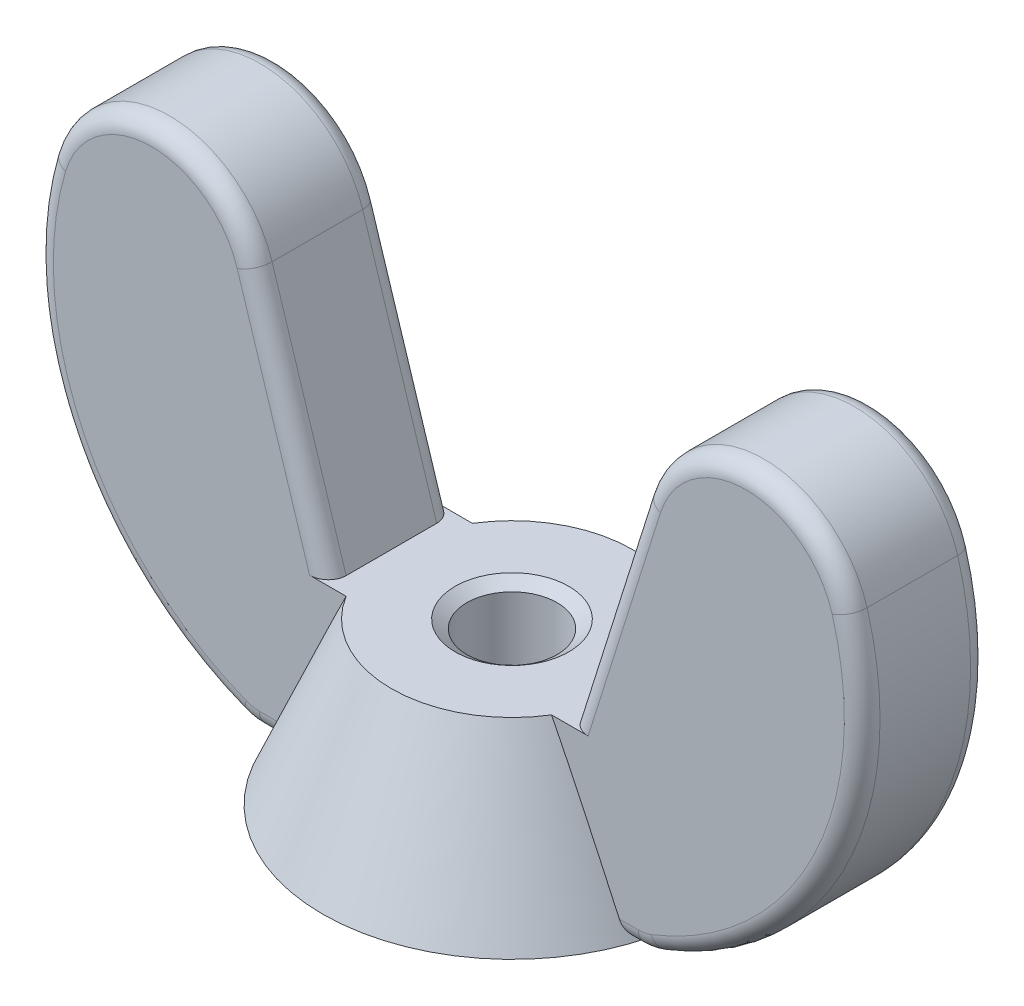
ISO-10303-21;
HEADER;
FILE_DESCRIPTION(('STEP AP214'),'2;1');
FILE_NAME('part.step','',(''),(''),'','','');
FILE_SCHEMA(('AUTOMOTIVE_DESIGN { 1 0 10303 214 1 1 1 1 }'));
ENDSEC;
DATA;
#1=APPLICATION_CONTEXT('core data for automotive mechanical design processes');
#2=APPLICATION_PROTOCOL_DEFINITION('international standard','automotive_design',2000,#1);
#3=PRODUCT_CONTEXT('',#1,'mechanical');
#4=PRODUCT('Part','Part','',(#3));
#5=PRODUCT_RELATED_PRODUCT_CATEGORY('part','',(#4));
#6=PRODUCT_DEFINITION_FORMATION('','',#4);
#7=PRODUCT_DEFINITION_CONTEXT('part definition',#1,'design');
#8=PRODUCT_DEFINITION('design','',#6,#7);
#9=PRODUCT_DEFINITION_SHAPE('','',#8);
#10=(LENGTH_UNIT() NAMED_UNIT(*) SI_UNIT(.MILLI.,.METRE.));
#11=(NAMED_UNIT(*) PLANE_ANGLE_UNIT() SI_UNIT($,.RADIAN.));
#12=(NAMED_UNIT(*) SI_UNIT($,.STERADIAN.) SOLID_ANGLE_UNIT());
#13=UNCERTAINTY_MEASURE_WITH_UNIT(LENGTH_MEASURE(1.E-05),#10,'distance_accuracy_value','');
#14=(GEOMETRIC_REPRESENTATION_CONTEXT(3) GLOBAL_UNCERTAINTY_ASSIGNED_CONTEXT((#13)) GLOBAL_UNIT_ASSIGNED_CONTEXT((#10,
#11,#12)) REPRESENTATION_CONTEXT('',''));
#15=CARTESIAN_POINT('',(0.,0.,0.));
#16=DIRECTION('',(0.,0.,1.));
#17=DIRECTION('',(1.,0.,0.));
#18=AXIS2_PLACEMENT_3D('',#15,#16,#17);
#19=CARTESIAN_POINT('',(4.19100000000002,0.,1.397));
#20=DIRECTION('',(0.,1.,0.));
#21=DIRECTION('',(-1.,0.,0.));
#22=AXIS2_PLACEMENT_3D('',#19,#20,#21);
#23=PLANE('',#22);
#24=CARTESIAN_POINT('',(0.,0.,0.));
#25=DIRECTION('',(0.,-1.,0.));
#26=DIRECTION('',(1.,0.,0.));
#27=AXIS2_PLACEMENT_3D('',#24,#25,#26);
#28=CIRCLE('',#27,4.191);
#29=CARTESIAN_POINT('',(-4.06948395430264,0.,-1.00188888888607));
#30=VERTEX_POINT('',#29);
#31=CARTESIAN_POINT('',(4.06948395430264,0.,-1.00188888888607));
#32=VERTEX_POINT('',#31);
#33=EDGE_CURVE('E589',#30,#32,#28,.T.);
#34=ORIENTED_EDGE('',*,*,#33,.T.);
#35=DIRECTION('',(1.,0.,0.));
#36=VECTOR('',#35,1.);
#37=CARTESIAN_POINT('',(4.19100000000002,0.,-1.00188888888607));
#38=LINE('',#37,#36);
#39=CARTESIAN_POINT('',(4.19100000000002,0.,-1.00188888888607));
#40=VERTEX_POINT('',#39);
#41=EDGE_CURVE('E570',#32,#40,#38,.T.);
#42=ORIENTED_EDGE('',*,*,#41,.T.);
#43=DIRECTION('',(0.,0.,-1.));
#44=VECTOR('',#43,1.);
#45=CARTESIAN_POINT('',(4.19100000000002,0.,1.397));
#46=LINE('',#45,#44);
#47=CARTESIAN_POINT('',(4.19100000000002,0.,1.00188888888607));
#48=VERTEX_POINT('',#47);
#49=EDGE_CURVE('E270',#48,#40,#46,.T.);
#50=ORIENTED_EDGE('',*,*,#49,.F.);
#51=DIRECTION('',(1.,0.,0.));
#52=VECTOR('',#51,1.);
#53=CARTESIAN_POINT('',(4.19100000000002,0.,1.00188888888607));
#54=LINE('',#53,#52);
#55=CARTESIAN_POINT('',(4.06948395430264,0.,1.00188888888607));
#56=VERTEX_POINT('',#55);
#57=EDGE_CURVE('E575',#48,#56,#54,.F.);
#58=ORIENTED_EDGE('',*,*,#57,.T.);
#59=CARTESIAN_POINT('',(-4.06948395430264,0.,1.00188888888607));
#60=VERTEX_POINT('',#59);
#61=EDGE_CURVE('E602',#56,#60,#28,.T.);
#62=ORIENTED_EDGE('',*,*,#61,.T.);
#63=DIRECTION('',(1.,0.,0.));
#64=VECTOR('',#63,1.);
#65=CARTESIAN_POINT('',(4.19100000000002,0.,1.00188888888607));
#66=LINE('',#65,#64);
#67=CARTESIAN_POINT('',(-4.191,0.,1.00188888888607));
#68=VERTEX_POINT('',#67);
#69=EDGE_CURVE('E290',#60,#68,#66,.F.);
#70=ORIENTED_EDGE('',*,*,#69,.T.);
#71=DIRECTION('',(0.,0.,-1.));
#72=VECTOR('',#71,1.);
#73=CARTESIAN_POINT('',(-4.191,0.,1.397));
#74=LINE('',#73,#72);
#75=CARTESIAN_POINT('',(-4.191,0.,-1.00188888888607));
#76=VERTEX_POINT('',#75);
#77=EDGE_CURVE('E273',#68,#76,#74,.T.);
#78=ORIENTED_EDGE('',*,*,#77,.T.);
#79=DIRECTION('',(1.,0.,0.));
#80=VECTOR('',#79,1.);
#81=CARTESIAN_POINT('',(-3.95131269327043,0.,-1.00188888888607));
#82=LINE('',#81,#80);
#83=EDGE_CURVE('E573',#76,#30,#82,.T.);
#84=ORIENTED_EDGE('',*,*,#83,.T.);
#85=EDGE_LOOP('',(#34,#42,#50,#58,#62,#70,#78,#84));
#86=FACE_BOUND('',#85,.T.);
#87=CARTESIAN_POINT('',(0.,0.,0.));
#88=DIRECTION('',(0.,1.,0.));
#89=DIRECTION('',(-1.,0.,0.));
#90=AXIS2_PLACEMENT_3D('',#87,#88,#89);
#91=CIRCLE('',#90,1.25729999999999);
#92=CARTESIAN_POINT('',(-1.25729999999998,0.,0.));
#93=VERTEX_POINT('',#92);
#94=EDGE_CURVE('E613',#93,#93,#91,.T.);
#95=ORIENTED_EDGE('',*,*,#94,.T.);
#96=EDGE_LOOP('',(#95));
#97=FACE_BOUND('',#96,.T.);
#98=ADVANCED_FACE('F47',(#86,#97),#23,.F.);
#99=CARTESIAN_POINT('',(6.57394378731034,8.03463214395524,1.397));
#100=DIRECTION('',(0.,0.,-1.));
#101=DIRECTION('',(-1.,0.,0.));
#102=AXIS2_PLACEMENT_3D('',#99,#100,#101);
#103=PLANE('',#102);
#104=CARTESIAN_POINT('',(3.95163088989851,-0.000700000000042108,1.397));
#105=CARTESIAN_POINT('',(3.85067053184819,0.221368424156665,1.397));
#106=CARTESIAN_POINT('',(3.74937862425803,0.44328737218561,1.397));
#107=CARTESIAN_POINT('',(3.54587621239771,0.886737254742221,1.397));
#108=CARTESIAN_POINT('',(3.44366559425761,1.10826813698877,1.397));
#109=CARTESIAN_POINT('',(3.23762359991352,1.55181284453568,1.397));
#110=CARTESIAN_POINT('',(3.13378693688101,1.77382421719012,1.397));
#111=CARTESIAN_POINT('',(2.92458489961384,2.21709884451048,1.397));
#112=CARTESIAN_POINT('',(2.81921968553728,2.4383621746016,1.397));
#113=CARTESIAN_POINT('',(2.60097199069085,2.8911044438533,1.397));
#114=CARTESIAN_POINT('',(2.48797974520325,3.12253055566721,1.397));
#115=CARTESIAN_POINT('',(2.2586039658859,3.58380222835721,1.397));
#116=CARTESIAN_POINT('',(2.14221935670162,3.81364725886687,1.397));
#117=CARTESIAN_POINT('',(1.96384375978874,4.15611573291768,1.397));
#118=CARTESIAN_POINT('',(1.9038212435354,4.26976309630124,1.397));
#119=CARTESIAN_POINT('',(1.78208118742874,4.49614451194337,1.397));
#120=CARTESIAN_POINT('',(1.72036371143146,4.60887859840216,1.397));
#121=CARTESIAN_POINT('',(1.59472519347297,4.8330381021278,1.397));
#122=CARTESIAN_POINT('',(1.53080532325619,4.94446417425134,1.397));
#123=CARTESIAN_POINT('',(1.39992922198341,5.16551188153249,1.397));
#124=CARTESIAN_POINT('',(1.33297355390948,5.27513384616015,1.397));
#125=CARTESIAN_POINT('',(1.22844946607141,5.43873841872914,1.397));
#126=CARTESIAN_POINT('',(1.19249617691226,5.49375148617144,1.397));
#127=CARTESIAN_POINT('',(1.11916006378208,5.6028371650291,1.397));
#128=CARTESIAN_POINT('',(1.0817769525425,5.6569095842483,1.397));
#129=CARTESIAN_POINT('',(1.00529069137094,5.76371382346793,1.397));
#130=CARTESIAN_POINT('',(0.966190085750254,5.81644745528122,1.397));
#131=CARTESIAN_POINT('',(0.885737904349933,5.92016029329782,1.397));
#132=CARTESIAN_POINT('',(0.844386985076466,5.97114000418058,1.397));
#133=CARTESIAN_POINT('',(0.75192139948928,6.07852886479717,1.397));
#134=CARTESIAN_POINT('',(0.700301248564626,6.13450753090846,1.397));
#135=CARTESIAN_POINT('',(0.59158933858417,6.24098711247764,1.397));
#136=CARTESIAN_POINT('',(0.534504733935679,6.29149501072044,1.397));
#137=CARTESIAN_POINT('',(0.436252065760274,6.36508374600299,1.397));
#138=CARTESIAN_POINT('',(0.397421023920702,6.39123602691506,1.397));
#139=CARTESIAN_POINT('',(0.316504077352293,6.43796908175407,1.397));
#140=CARTESIAN_POINT('',(0.274423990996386,6.45855953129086,1.397));
#141=CARTESIAN_POINT('',(0.197080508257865,6.48796833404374,1.397));
#142=CARTESIAN_POINT('',(0.162442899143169,6.49839889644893,1.397));
#143=CARTESIAN_POINT('',(0.0919185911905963,6.51330739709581,1.397));
#144=CARTESIAN_POINT('',(0.0560339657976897,6.51779477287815,1.397));
#145=CARTESIAN_POINT('',(-0.0160942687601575,6.5202058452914,1.397));
#146=CARTESIAN_POINT('',(-0.0523387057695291,6.51810581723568,1.397));
#147=CARTESIAN_POINT('',(-0.123907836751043,6.50760308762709,1.397));
#148=CARTESIAN_POINT('',(-0.159231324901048,6.49919251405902,1.397));
#149=CARTESIAN_POINT('',(-0.239922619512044,6.47333948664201,1.397));
#150=CARTESIAN_POINT('',(-0.2846024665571,6.45379383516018,1.397));
#151=CARTESIAN_POINT('',(-0.370427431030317,6.40810858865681,1.397));
#152=CARTESIAN_POINT('',(-0.411562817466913,6.38195157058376,1.397));
#153=CARTESIAN_POINT('',(-0.501279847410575,6.3176305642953,1.397));
#154=CARTESIAN_POINT('',(-0.548884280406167,6.27812996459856,1.397));
#155=CARTESIAN_POINT('',(-0.640140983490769,6.19474761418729,1.397));
#156=CARTESIAN_POINT('',(-0.683784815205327,6.15085690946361,1.397));
#157=CARTESIAN_POINT('',(-0.768283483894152,6.0599442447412,1.397));
#158=CARTESIAN_POINT('',(-0.809117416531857,6.01290308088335,1.397));
#159=CARTESIAN_POINT('',(-0.888344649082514,5.91691190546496,1.397));
#160=CARTESIAN_POINT('',(-0.9267404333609,5.86796392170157,1.397));
#161=CARTESIAN_POINT('',(-1.00521590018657,5.76395220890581,1.397));
#162=CARTESIAN_POINT('',(-1.04510956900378,5.70874893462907,1.397));
#163=CARTESIAN_POINT('',(-1.12314354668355,5.59711248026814,1.397));
#164=CARTESIAN_POINT('',(-1.16128358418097,5.54067911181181,1.397));
#165=CARTESIAN_POINT('',(-1.27366302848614,5.36994653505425,1.397));
#166=CARTESIAN_POINT('',(-1.3458162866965,5.25427711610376,1.397));
#167=CARTESIAN_POINT('',(-1.48656475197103,5.02045176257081,1.397));
#168=CARTESIAN_POINT('',(-1.55515108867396,4.90229056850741,1.397));
#169=CARTESIAN_POINT('',(-1.6896326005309,4.66450328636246,1.397));
#170=CARTESIAN_POINT('',(-1.75552866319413,4.54487769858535,1.397));
#171=CARTESIAN_POINT('',(-1.88533994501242,4.3045813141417,1.397));
#172=CARTESIAN_POINT('',(-1.94925541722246,4.18391065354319,1.397));
#173=CARTESIAN_POINT('',(-2.07557926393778,3.94177267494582,1.397));
#174=CARTESIAN_POINT('',(-2.1379875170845,3.82030529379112,1.397));
#175=CARTESIAN_POINT('',(-2.32329113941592,3.45533387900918,1.397));
#176=CARTESIAN_POINT('',(-2.44443506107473,3.21094169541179,1.397));
#177=CARTESIAN_POINT('',(-2.68411262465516,2.71982478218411,1.397));
#178=CARTESIAN_POINT('',(-2.80263557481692,2.47309486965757,1.397));
#179=CARTESIAN_POINT('',(-3.03760284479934,1.97851862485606,1.397));
#180=CARTESIAN_POINT('',(-3.15404624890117,1.7306718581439,1.397));
#181=CARTESIAN_POINT('',(-3.38467991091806,1.23580616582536,1.397));
#182=CARTESIAN_POINT('',(-3.49887967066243,0.988791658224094,1.397));
#183=CARTESIAN_POINT('',(-3.7260640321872,0.494345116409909,1.397));
#184=CARTESIAN_POINT('',(-3.83904918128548,0.246913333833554,1.397));
#185=CARTESIAN_POINT('',(-3.95163088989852,-0.000700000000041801,1.397));
#186=B_SPLINE_CURVE_WITH_KNOTS('',3,(#104,#105,#106,#107,#108,#109,#110,#111,#112,#113,#114,
#115,#116,#117,#118,#119,#120,#121,#122,#123,#124,#125,#126,#127,#128,#129,#130,#131,#132,#133,
#134,#135,#136,#137,#138,#139,#140,#141,#142,#143,#144,#145,#146,#147,#148,#149,#150,#151,#152,
#153,#154,#155,#156,#157,#158,#159,#160,#161,#162,#163,#164,#165,#166,#167,#168,#169,#170,#171,
#172,#173,#174,#175,#176,#177,#178,#179,#180,#181,#182,#183,#184,#185),.UNSPECIFIED.,.F.,.F.,(4,
2,2,2,2,2,2,2,2,2,2,2,2,2,2,2,2,2,2,2,2,2,2,2,2,2,2,2,2,2,2,2,2,2,2,2,2,2,2,2,4),(0.,
0.731825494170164,1.46374298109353,2.19902096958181,2.93422246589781,3.70681885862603,
4.47966288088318,4.86522484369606,5.25077230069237,5.63611770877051,6.02139194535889,
6.21853438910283,6.4157166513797,6.61261605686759,6.80945832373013,7.03768861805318,
7.26562408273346,7.40577574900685,7.54568200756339,7.65377461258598,7.76169536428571,
7.87000524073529,7.97845045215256,8.12391883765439,8.26977465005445,8.45490196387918,
8.6404148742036,8.82718494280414,9.01376154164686,9.21804502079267,9.4223600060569,
9.8312209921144,10.2410543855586,10.650751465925,11.0603959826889,11.4700733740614,
12.2883447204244,13.1094969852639,13.9310023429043,14.7474058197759,15.5634245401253),.UNSPECIFIED.);
#187=CARTESIAN_POINT('',(3.77123239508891,0.395111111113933,1.397));
#188=VERTEX_POINT('',#187);
#189=CARTESIAN_POINT('',(2.27184506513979,3.556,1.397));
#190=VERTEX_POINT('',#189);
#191=EDGE_CURVE('E248',#188,#190,#186,.T.);
#192=ORIENTED_EDGE('',*,*,#191,.F.);
#193=DIRECTION('',(1.,0.,0.));
#194=VECTOR('',#193,1.);
#195=CARTESIAN_POINT('',(6.57394378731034,0.395111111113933,1.397));
#196=LINE('',#195,#194);
#197=CARTESIAN_POINT('',(4.19100000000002,0.395111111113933,1.397));
#198=VERTEX_POINT('',#197);
#199=EDGE_CURVE('E518',#188,#198,#196,.T.);
#200=ORIENTED_EDGE('',*,*,#199,.T.);
#201=CARTESIAN_POINT('',(4.19100000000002,1.18533333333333,1.397));
#202=DIRECTION('',(0.,0.,-1.));
#203=DIRECTION('',(-1.,0.,0.));
#204=AXIS2_PLACEMENT_3D('',#201,#202,#203);
#205=CIRCLE('',#204,0.7902222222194);
#206=CARTESIAN_POINT('',(4.47886666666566,0.449409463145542,1.397));
#207=VERTEX_POINT('',#206);
#208=EDGE_CURVE('E521',#198,#207,#205,.F.);
#209=ORIENTED_EDGE('',*,*,#208,.T.);
#210=CARTESIAN_POINT('',(2.03200000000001,6.7047623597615,1.397));
#211=DIRECTION('',(0.,0.,-1.));
#212=DIRECTION('',(-1.,0.,0.));
#213=AXIS2_PLACEMENT_3D('',#210,#211,#212);
#214=CIRCLE('',#213,6.71688888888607);
#215=CARTESIAN_POINT('',(8.47825038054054,8.592208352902,1.397));
#216=VERTEX_POINT('',#215);
#217=EDGE_CURVE('E523',#207,#216,#214,.F.);
#218=ORIENTED_EDGE('',*,*,#217,.T.);
#219=CARTESIAN_POINT('',(6.57394378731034,8.03463214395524,1.397));
#220=DIRECTION('',(0.,0.,-1.));
#221=DIRECTION('',(-1.,0.,0.));
#222=AXIS2_PLACEMENT_3D('',#219,#220,#221);
#223=CIRCLE('',#222,1.98425674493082);
#224=CARTESIAN_POINT('',(4.68152449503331,8.63130965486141,1.397));
#225=VERTEX_POINT('',#224);
#226=EDGE_CURVE('E525',#216,#225,#223,.F.);
#227=ORIENTED_EDGE('',*,*,#226,.T.);
#228=DIRECTION('',(-0.30070579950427,-0.953716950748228,0.));
#229=VECTOR('',#228,1.);
#230=CARTESIAN_POINT('',(4.68152449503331,8.63130965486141,1.397));
#231=LINE('',#230,#229);
#232=CARTESIAN_POINT('',(3.08128550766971,3.556,1.397));
#233=VERTEX_POINT('',#232);
#234=EDGE_CURVE('E527',#225,#233,#231,.T.);
#235=ORIENTED_EDGE('',*,*,#234,.T.);
#236=DIRECTION('',(-1.,0.,0.));
#237=VECTOR('',#236,1.);
#238=CARTESIAN_POINT('',(-2.66699999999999,3.556,1.397));
#239=LINE('',#238,#237);
#240=EDGE_CURVE('E255',#233,#190,#239,.T.);
#241=ORIENTED_EDGE('',*,*,#240,.T.);
#242=EDGE_LOOP('',(#192,#200,#209,#218,#227,#235,#241));
#243=FACE_BOUND('',#242,.T.);
#244=ADVANCED_FACE('F302',(#243),#103,.F.);
#245=CARTESIAN_POINT('',(-4.191,1.18533333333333,1.397));
#246=DIRECTION('',(0.,0.,-1.));
#247=DIRECTION('',(-1.,0.,0.));
#248=AXIS2_PLACEMENT_3D('',#245,#246,#247);
#249=CIRCLE('',#248,0.7902222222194);
#250=CARTESIAN_POINT('',(-4.47886666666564,0.449409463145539,1.397));
#251=VERTEX_POINT('',#250);
#252=CARTESIAN_POINT('',(-4.191,0.395111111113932,1.397));
#253=VERTEX_POINT('',#252);
#254=EDGE_CURVE('E512',#251,#253,#249,.F.);
#255=ORIENTED_EDGE('',*,*,#254,.T.);
#256=DIRECTION('',(1.,0.,0.));
#257=VECTOR('',#256,1.);
#258=CARTESIAN_POINT('',(6.57394378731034,0.395111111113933,1.397));
#259=LINE('',#258,#257);
#260=CARTESIAN_POINT('',(-3.77123239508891,0.395111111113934,1.397));
#261=VERTEX_POINT('',#260);
#262=EDGE_CURVE('E509',#253,#261,#259,.T.);
#263=ORIENTED_EDGE('',*,*,#262,.T.);
#264=CARTESIAN_POINT('',(-2.27184506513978,3.556,1.397));
#265=VERTEX_POINT('',#264);
#266=EDGE_CURVE('E251',#265,#261,#186,.T.);
#267=ORIENTED_EDGE('',*,*,#266,.F.);
#268=CARTESIAN_POINT('',(-3.0812855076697,3.556,1.397));
#269=VERTEX_POINT('',#268);
#270=EDGE_CURVE('E250',#265,#269,#239,.T.);
#271=ORIENTED_EDGE('',*,*,#270,.T.);
#272=DIRECTION('',(-0.300705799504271,0.953716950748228,0.));
#273=VECTOR('',#272,1.);
#274=CARTESIAN_POINT('',(-3.49264020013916,4.86065040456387,1.397));
#275=LINE('',#274,#273);
#276=CARTESIAN_POINT('',(-4.6815244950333,8.6313096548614,1.397));
#277=VERTEX_POINT('',#276);
#278=EDGE_CURVE('E501',#269,#277,#275,.T.);
#279=ORIENTED_EDGE('',*,*,#278,.T.);
#280=CARTESIAN_POINT('',(-6.57394378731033,8.03463214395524,1.397));
#281=DIRECTION('',(0.,0.,-1.));
#282=DIRECTION('',(-1.,0.,0.));
#283=AXIS2_PLACEMENT_3D('',#280,#281,#282);
#284=CIRCLE('',#283,1.98425674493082);
#285=CARTESIAN_POINT('',(-8.47825038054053,8.592208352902,1.397));
#286=VERTEX_POINT('',#285);
#287=EDGE_CURVE('E498',#277,#286,#284,.F.);
#288=ORIENTED_EDGE('',*,*,#287,.T.);
#289=CARTESIAN_POINT('',(-2.03199999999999,6.70476235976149,1.397));
#290=DIRECTION('',(0.,0.,-1.));
#291=DIRECTION('',(-1.,0.,0.));
#292=AXIS2_PLACEMENT_3D('',#289,#290,#291);
#293=CIRCLE('',#292,6.71688888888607);
#294=EDGE_CURVE('E514',#286,#251,#293,.F.);
#295=ORIENTED_EDGE('',*,*,#294,.T.);
#296=EDGE_LOOP('',(#255,#263,#267,#271,#279,#288,#295));
#297=FACE_BOUND('',#296,.T.);
#298=ADVANCED_FACE('F394',(#297),#103,.F.);
#299=CARTESIAN_POINT('',(6.57394378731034,8.03463214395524,-1.397));
#300=DIRECTION('',(0.,0.,-1.));
#301=DIRECTION('',(-1.,0.,0.));
#302=AXIS2_PLACEMENT_3D('',#299,#300,#301);
#303=PLANE('',#302);
#304=CARTESIAN_POINT('',(4.19100000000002,1.18533333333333,-1.397));
#305=DIRECTION('',(0.,0.,-1.));
#306=DIRECTION('',(-1.,0.,0.));
#307=AXIS2_PLACEMENT_3D('',#304,#305,#306);
#308=CIRCLE('',#307,0.7902222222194);
#309=CARTESIAN_POINT('',(4.47886666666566,0.449409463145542,-1.397));
#310=VERTEX_POINT('',#309);
#311=CARTESIAN_POINT('',(4.19100000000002,0.395111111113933,-1.397));
#312=VERTEX_POINT('',#311);
#313=EDGE_CURVE('E562',#310,#312,#308,.T.);
#314=ORIENTED_EDGE('',*,*,#313,.T.);
#315=DIRECTION('',(1.,0.,0.));
#316=VECTOR('',#315,1.);
#317=CARTESIAN_POINT('',(3.95131269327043,0.395111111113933,-1.397));
#318=LINE('',#317,#316);
#319=CARTESIAN_POINT('',(3.7712323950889,0.395111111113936,-1.397));
#320=VERTEX_POINT('',#319);
#321=EDGE_CURVE('E560',#312,#320,#318,.F.);
#322=ORIENTED_EDGE('',*,*,#321,.T.);
#323=CARTESIAN_POINT('',(3.95163088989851,-0.000700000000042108,-1.397));
#324=CARTESIAN_POINT('',(3.85067053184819,0.221368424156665,-1.397));
#325=CARTESIAN_POINT('',(3.74937862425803,0.44328737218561,-1.397));
#326=CARTESIAN_POINT('',(3.54587621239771,0.886737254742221,-1.397));
#327=CARTESIAN_POINT('',(3.44366559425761,1.10826813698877,-1.397));
#328=CARTESIAN_POINT('',(3.23762359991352,1.55181284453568,-1.397));
#329=CARTESIAN_POINT('',(3.13378693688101,1.77382421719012,-1.397));
#330=CARTESIAN_POINT('',(2.92458489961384,2.21709884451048,-1.397));
#331=CARTESIAN_POINT('',(2.81921968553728,2.4383621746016,-1.397));
#332=CARTESIAN_POINT('',(2.60097199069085,2.8911044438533,-1.397));
#333=CARTESIAN_POINT('',(2.48797974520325,3.12253055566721,-1.397));
#334=CARTESIAN_POINT('',(2.2586039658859,3.58380222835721,-1.397));
#335=CARTESIAN_POINT('',(2.14221935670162,3.81364725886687,-1.397));
#336=CARTESIAN_POINT('',(1.96384375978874,4.15611573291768,-1.397));
#337=CARTESIAN_POINT('',(1.9038212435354,4.26976309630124,-1.397));
#338=CARTESIAN_POINT('',(1.78208118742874,4.49614451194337,-1.397));
#339=CARTESIAN_POINT('',(1.72036371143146,4.60887859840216,-1.397));
#340=CARTESIAN_POINT('',(1.59472519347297,4.8330381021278,-1.397));
#341=CARTESIAN_POINT('',(1.53080532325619,4.94446417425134,-1.397));
#342=CARTESIAN_POINT('',(1.39992922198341,5.16551188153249,-1.397));
#343=CARTESIAN_POINT('',(1.33297355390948,5.27513384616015,-1.397));
#344=CARTESIAN_POINT('',(1.22844946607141,5.43873841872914,-1.397));
#345=CARTESIAN_POINT('',(1.19249617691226,5.49375148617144,-1.397));
#346=CARTESIAN_POINT('',(1.11916006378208,5.6028371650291,-1.397));
#347=CARTESIAN_POINT('',(1.0817769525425,5.6569095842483,-1.397));
#348=CARTESIAN_POINT('',(1.00529069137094,5.76371382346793,-1.397));
#349=CARTESIAN_POINT('',(0.966190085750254,5.81644745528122,-1.397));
#350=CARTESIAN_POINT('',(0.885737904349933,5.92016029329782,-1.397));
#351=CARTESIAN_POINT('',(0.844386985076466,5.97114000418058,-1.397));
#352=CARTESIAN_POINT('',(0.75192139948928,6.07852886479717,-1.397));
#353=CARTESIAN_POINT('',(0.700301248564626,6.13450753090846,-1.397));
#354=CARTESIAN_POINT('',(0.59158933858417,6.24098711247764,-1.397));
#355=CARTESIAN_POINT('',(0.534504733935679,6.29149501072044,-1.397));
#356=CARTESIAN_POINT('',(0.436252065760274,6.36508374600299,-1.397));
#357=CARTESIAN_POINT('',(0.397421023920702,6.39123602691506,-1.397));
#358=CARTESIAN_POINT('',(0.316504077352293,6.43796908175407,-1.397));
#359=CARTESIAN_POINT('',(0.274423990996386,6.45855953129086,-1.397));
#360=CARTESIAN_POINT('',(0.197080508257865,6.48796833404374,-1.397));
#361=CARTESIAN_POINT('',(0.162442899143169,6.49839889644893,-1.397));
#362=CARTESIAN_POINT('',(0.0919185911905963,6.51330739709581,-1.397));
#363=CARTESIAN_POINT('',(0.0560339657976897,6.51779477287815,-1.397));
#364=CARTESIAN_POINT('',(-0.0160942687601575,6.5202058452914,-1.397));
#365=CARTESIAN_POINT('',(-0.0523387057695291,6.51810581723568,-1.397));
#366=CARTESIAN_POINT('',(-0.123907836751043,6.50760308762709,-1.397));
#367=CARTESIAN_POINT('',(-0.159231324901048,6.49919251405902,-1.397));
#368=CARTESIAN_POINT('',(-0.239922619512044,6.47333948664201,-1.397));
#369=CARTESIAN_POINT('',(-0.2846024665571,6.45379383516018,-1.397));
#370=CARTESIAN_POINT('',(-0.370427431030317,6.40810858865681,-1.397));
#371=CARTESIAN_POINT('',(-0.411562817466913,6.38195157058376,-1.397));
#372=CARTESIAN_POINT('',(-0.501279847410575,6.3176305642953,-1.397));
#373=CARTESIAN_POINT('',(-0.548884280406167,6.27812996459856,-1.397));
#374=CARTESIAN_POINT('',(-0.640140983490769,6.19474761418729,-1.397));
#375=CARTESIAN_POINT('',(-0.683784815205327,6.15085690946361,-1.397));
#376=CARTESIAN_POINT('',(-0.768283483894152,6.0599442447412,-1.397));
#377=CARTESIAN_POINT('',(-0.809117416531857,6.01290308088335,-1.397));
#378=CARTESIAN_POINT('',(-0.888344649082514,5.91691190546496,-1.397));
#379=CARTESIAN_POINT('',(-0.9267404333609,5.86796392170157,-1.397));
#380=CARTESIAN_POINT('',(-1.00521590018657,5.76395220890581,-1.397));
#381=CARTESIAN_POINT('',(-1.04510956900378,5.70874893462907,-1.397));
#382=CARTESIAN_POINT('',(-1.12314354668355,5.59711248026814,-1.397));
#383=CARTESIAN_POINT('',(-1.16128358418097,5.54067911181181,-1.397));
#384=CARTESIAN_POINT('',(-1.27366302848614,5.36994653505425,-1.397));
#385=CARTESIAN_POINT('',(-1.3458162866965,5.25427711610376,-1.397));
#386=CARTESIAN_POINT('',(-1.48656475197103,5.02045176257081,-1.397));
#387=CARTESIAN_POINT('',(-1.55515108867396,4.90229056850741,-1.397));
#388=CARTESIAN_POINT('',(-1.6896326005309,4.66450328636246,-1.397));
#389=CARTESIAN_POINT('',(-1.75552866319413,4.54487769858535,-1.397));
#390=CARTESIAN_POINT('',(-1.88533994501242,4.3045813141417,-1.397));
#391=CARTESIAN_POINT('',(-1.94925541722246,4.18391065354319,-1.397));
#392=CARTESIAN_POINT('',(-2.07557926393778,3.94177267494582,-1.397));
#393=CARTESIAN_POINT('',(-2.1379875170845,3.82030529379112,-1.397));
#394=CARTESIAN_POINT('',(-2.32329113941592,3.45533387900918,-1.397));
#395=CARTESIAN_POINT('',(-2.44443506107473,3.21094169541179,-1.397));
#396=CARTESIAN_POINT('',(-2.68411262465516,2.71982478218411,-1.397));
#397=CARTESIAN_POINT('',(-2.80263557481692,2.47309486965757,-1.397));
#398=CARTESIAN_POINT('',(-3.03760284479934,1.97851862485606,-1.397));
#399=CARTESIAN_POINT('',(-3.15404624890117,1.7306718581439,-1.397));
#400=CARTESIAN_POINT('',(-3.38467991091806,1.23580616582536,-1.397));
#401=CARTESIAN_POINT('',(-3.49887967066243,0.988791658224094,-1.397));
#402=CARTESIAN_POINT('',(-3.7260640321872,0.494345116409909,-1.397));
#403=CARTESIAN_POINT('',(-3.83904918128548,0.246913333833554,-1.397));
#404=CARTESIAN_POINT('',(-3.95163088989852,-0.000700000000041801,-1.397));
#405=B_SPLINE_CURVE_WITH_KNOTS('',3,(#323,#324,#325,#326,#327,#328,#329,#330,#331,#332,#333,
#334,#335,#336,#337,#338,#339,#340,#341,#342,#343,#344,#345,#346,#347,#348,#349,#350,#351,#352,
#353,#354,#355,#356,#357,#358,#359,#360,#361,#362,#363,#364,#365,#366,#367,#368,#369,#370,#371,
#372,#373,#374,#375,#376,#377,#378,#379,#380,#381,#382,#383,#384,#385,#386,#387,#388,#389,#390,
#391,#392,#393,#394,#395,#396,#397,#398,#399,#400,#401,#402,#403,#404),.UNSPECIFIED.,.F.,.F.,(4,
2,2,2,2,2,2,2,2,2,2,2,2,2,2,2,2,2,2,2,2,2,2,2,2,2,2,2,2,2,2,2,2,2,2,2,2,2,2,2,4),(0.,
0.731825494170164,1.46374298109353,2.19902096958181,2.93422246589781,3.70681885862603,
4.47966288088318,4.86522484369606,5.25077230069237,5.63611770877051,6.02139194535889,
6.21853438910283,6.4157166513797,6.61261605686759,6.80945832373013,7.03768861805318,
7.26562408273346,7.40577574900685,7.54568200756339,7.65377461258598,7.76169536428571,
7.87000524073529,7.97845045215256,8.12391883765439,8.26977465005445,8.45490196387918,
8.6404148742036,8.82718494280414,9.01376154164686,9.21804502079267,9.4223600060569,
9.8312209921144,10.2410543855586,10.650751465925,11.0603959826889,11.4700733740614,
12.2883447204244,13.1094969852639,13.9310023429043,14.7474058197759,15.5634245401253),.UNSPECIFIED.);
#406=CARTESIAN_POINT('',(2.27184506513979,3.55599999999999,-1.397));
#407=VERTEX_POINT('',#406);
#408=EDGE_CURVE('E234',#320,#407,#405,.T.);
#409=ORIENTED_EDGE('',*,*,#408,.T.);
#410=DIRECTION('',(-1.,0.,0.));
#411=VECTOR('',#410,1.);
#412=CARTESIAN_POINT('',(-2.66699999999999,3.556,-1.397));
#413=LINE('',#412,#411);
#414=CARTESIAN_POINT('',(3.08128550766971,3.556,-1.397));
#415=VERTEX_POINT('',#414);
#416=EDGE_CURVE('E241',#415,#407,#413,.T.);
#417=ORIENTED_EDGE('',*,*,#416,.F.);
#418=DIRECTION('',(-0.30070579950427,-0.953716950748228,0.));
#419=VECTOR('',#418,1.);
#420=CARTESIAN_POINT('',(4.68152449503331,8.63130965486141,-1.397));
#421=LINE('',#420,#419);
#422=CARTESIAN_POINT('',(4.68152449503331,8.63130965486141,-1.397));
#423=VERTEX_POINT('',#422);
#424=EDGE_CURVE('E568',#415,#423,#421,.F.);
#425=ORIENTED_EDGE('',*,*,#424,.T.);
#426=CARTESIAN_POINT('',(6.57394378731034,8.03463214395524,-1.397));
#427=DIRECTION('',(0.,0.,-1.));
#428=DIRECTION('',(-1.,0.,0.));
#429=AXIS2_PLACEMENT_3D('',#426,#427,#428);
#430=CIRCLE('',#429,1.98425674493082);
#431=CARTESIAN_POINT('',(8.47825038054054,8.592208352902,-1.397));
#432=VERTEX_POINT('',#431);
#433=EDGE_CURVE('E566',#423,#432,#430,.T.);
#434=ORIENTED_EDGE('',*,*,#433,.T.);
#435=CARTESIAN_POINT('',(2.03200000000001,6.7047623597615,-1.397));
#436=DIRECTION('',(0.,0.,-1.));
#437=DIRECTION('',(-1.,0.,0.));
#438=AXIS2_PLACEMENT_3D('',#435,#436,#437);
#439=CIRCLE('',#438,6.71688888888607);
#440=EDGE_CURVE('E564',#432,#310,#439,.T.);
#441=ORIENTED_EDGE('',*,*,#440,.T.);
#442=EDGE_LOOP('',(#314,#322,#409,#417,#425,#434,#441));
#443=FACE_BOUND('',#442,.T.);
#444=ADVANCED_FACE('F292',(#443),#303,.T.);
#445=CARTESIAN_POINT('',(-2.27184506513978,3.556,-1.397));
#446=VERTEX_POINT('',#445);
#447=CARTESIAN_POINT('',(-3.77123239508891,0.395111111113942,-1.397));
#448=VERTEX_POINT('',#447);
#449=EDGE_CURVE('E223',#446,#448,#405,.T.);
#450=ORIENTED_EDGE('',*,*,#449,.T.);
#451=DIRECTION('',(1.,0.,0.));
#452=VECTOR('',#451,1.);
#453=CARTESIAN_POINT('',(-4.191,0.395111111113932,-1.397));
#454=LINE('',#453,#452);
#455=CARTESIAN_POINT('',(-4.191,0.395111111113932,-1.397));
#456=VERTEX_POINT('',#455);
#457=EDGE_CURVE('E540',#448,#456,#454,.F.);
#458=ORIENTED_EDGE('',*,*,#457,.T.);
#459=CARTESIAN_POINT('',(-4.191,1.18533333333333,-1.397));
#460=DIRECTION('',(0.,0.,-1.));
#461=DIRECTION('',(-1.,0.,0.));
#462=AXIS2_PLACEMENT_3D('',#459,#460,#461);
#463=CIRCLE('',#462,0.7902222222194);
#464=CARTESIAN_POINT('',(-4.47886666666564,0.449409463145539,-1.397));
#465=VERTEX_POINT('',#464);
#466=EDGE_CURVE('E542',#456,#465,#463,.T.);
#467=ORIENTED_EDGE('',*,*,#466,.T.);
#468=CARTESIAN_POINT('',(-2.03199999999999,6.70476235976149,-1.397));
#469=DIRECTION('',(0.,0.,-1.));
#470=DIRECTION('',(-1.,0.,0.));
#471=AXIS2_PLACEMENT_3D('',#468,#469,#470);
#472=CIRCLE('',#471,6.71688888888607);
#473=CARTESIAN_POINT('',(-8.47825038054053,8.592208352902,-1.397));
#474=VERTEX_POINT('',#473);
#475=EDGE_CURVE('E544',#465,#474,#472,.T.);
#476=ORIENTED_EDGE('',*,*,#475,.T.);
#477=CARTESIAN_POINT('',(-6.57394378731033,8.03463214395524,-1.397));
#478=DIRECTION('',(0.,0.,-1.));
#479=DIRECTION('',(-1.,0.,0.));
#480=AXIS2_PLACEMENT_3D('',#477,#478,#479);
#481=CIRCLE('',#480,1.98425674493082);
#482=CARTESIAN_POINT('',(-4.6815244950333,8.6313096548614,-1.397));
#483=VERTEX_POINT('',#482);
#484=EDGE_CURVE('E459',#474,#483,#481,.T.);
#485=ORIENTED_EDGE('',*,*,#484,.T.);
#486=DIRECTION('',(-0.300705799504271,0.953716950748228,0.));
#487=VECTOR('',#486,1.);
#488=CARTESIAN_POINT('',(-3.04382416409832,3.43718779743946,-1.397));
#489=LINE('',#488,#487);
#490=CARTESIAN_POINT('',(-3.0812855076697,3.556,-1.397));
#491=VERTEX_POINT('',#490);
#492=EDGE_CURVE('E247',#483,#491,#489,.F.);
#493=ORIENTED_EDGE('',*,*,#492,.T.);
#494=EDGE_CURVE('E238',#446,#491,#413,.T.);
#495=ORIENTED_EDGE('',*,*,#494,.F.);
#496=EDGE_LOOP('',(#450,#458,#467,#476,#485,#493,#495));
#497=FACE_BOUND('',#496,.T.);
#498=ADVANCED_FACE('F245',(#497),#303,.T.);
#499=CARTESIAN_POINT('',(-4.30470033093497,8.75012185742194,1.397));
#500=DIRECTION('',(-0.953716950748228,-0.300705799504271,0.));
#501=DIRECTION('',(0.300705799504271,-0.953716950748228,0.));
#502=AXIS2_PLACEMENT_3D('',#499,#500,#501);
#503=PLANE('',#502);
#504=DIRECTION('',(0.,0.,-1.));
#505=VECTOR('',#504,1.);
#506=CARTESIAN_POINT('',(-2.66699999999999,3.556,1.397));
#507=LINE('',#506,#505);
#508=CARTESIAN_POINT('',(-2.66699999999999,3.556,1.00188888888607));
#509=VERTEX_POINT('',#508);
#510=CARTESIAN_POINT('',(-2.66699999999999,3.556,-1.00188888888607));
#511=VERTEX_POINT('',#510);
#512=EDGE_CURVE('E256',#509,#511,#507,.T.);
#513=ORIENTED_EDGE('',*,*,#512,.T.);
#514=DIRECTION('',(-0.300705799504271,0.953716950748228,0.));
#515=VECTOR('',#514,1.);
#516=CARTESIAN_POINT('',(-4.30470033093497,8.75012185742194,-1.00188888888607));
#517=LINE('',#516,#515);
#518=CARTESIAN_POINT('',(-4.30470033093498,8.75012185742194,-1.00188888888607));
#519=VERTEX_POINT('',#518);
#520=EDGE_CURVE('E502',#511,#519,#517,.T.);
#521=ORIENTED_EDGE('',*,*,#520,.T.);
#522=DIRECTION('',(0.,0.,-1.));
#523=VECTOR('',#522,1.);
#524=CARTESIAN_POINT('',(-4.30470033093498,8.75012185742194,1.397));
#525=LINE('',#524,#523);
#526=CARTESIAN_POINT('',(-4.30470033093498,8.75012185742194,1.00188888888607));
#527=VERTEX_POINT('',#526);
#528=EDGE_CURVE('E235',#527,#519,#525,.T.);
#529=ORIENTED_EDGE('',*,*,#528,.F.);
#530=DIRECTION('',(-0.300705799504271,0.953716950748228,0.));
#531=VECTOR('',#530,1.);
#532=CARTESIAN_POINT('',(-4.30470033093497,8.75012185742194,1.00188888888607));
#533=LINE('',#532,#531);
#534=EDGE_CURVE('E71',#527,#509,#533,.F.);
#535=ORIENTED_EDGE('',*,*,#534,.T.);
#536=EDGE_LOOP('',(#513,#521,#529,#535));
#537=FACE_BOUND('',#536,.T.);
#538=ADVANCED_FACE('F412',(#537),#503,.F.);
#539=CARTESIAN_POINT('',(-6.57394378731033,8.03463214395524,1.397));
#540=DIRECTION('',(0.,0.,-1.));
#541=DIRECTION('',(-1.,0.,0.));
#542=AXIS2_PLACEMENT_3D('',#539,#540,#541);
#543=CYLINDRICAL_SURFACE('',#542,2.37936785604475);
#544=ORIENTED_EDGE('',*,*,#528,.T.);
#545=CARTESIAN_POINT('',(-6.57394378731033,8.03463214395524,-1.00188888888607));
#546=DIRECTION('',(0.,0.,-1.));
#547=DIRECTION('',(-1.,0.,0.));
#548=AXIS2_PLACEMENT_3D('',#545,#546,#547);
#549=CIRCLE('',#548,2.37936785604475);
#550=CARTESIAN_POINT('',(-8.85744157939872,8.70323458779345,-1.00188888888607));
#551=VERTEX_POINT('',#550);
#552=EDGE_CURVE('E461',#519,#551,#549,.F.);
#553=ORIENTED_EDGE('',*,*,#552,.T.);
#554=DIRECTION('',(0.,0.,-1.));
#555=VECTOR('',#554,1.);
#556=CARTESIAN_POINT('',(-8.85744157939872,8.70323458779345,1.397));
#557=LINE('',#556,#555);
#558=CARTESIAN_POINT('',(-8.85744157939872,8.70323458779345,1.00188888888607));
#559=VERTEX_POINT('',#558);
#560=EDGE_CURVE('E279',#559,#551,#557,.T.);
#561=ORIENTED_EDGE('',*,*,#560,.F.);
#562=CARTESIAN_POINT('',(-6.57394378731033,8.03463214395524,1.00188888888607));
#563=DIRECTION('',(0.,0.,-1.));
#564=DIRECTION('',(-1.,0.,0.));
#565=AXIS2_PLACEMENT_3D('',#562,#563,#564);
#566=CIRCLE('',#565,2.37936785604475);
#567=EDGE_CURVE('E497',#559,#527,#566,.T.);
#568=ORIENTED_EDGE('',*,*,#567,.T.);
#569=EDGE_LOOP('',(#544,#553,#561,#568));
#570=FACE_BOUND('',#569,.T.);
#571=ADVANCED_FACE('F408',(#570),#543,.T.);
#572=CARTESIAN_POINT('',(-2.03199999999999,6.70476235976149,1.397));
#573=DIRECTION('',(0.,0.,-1.));
#574=DIRECTION('',(-1.,0.,0.));
#575=AXIS2_PLACEMENT_3D('',#572,#573,#574);
#576=CYLINDRICAL_SURFACE('',#575,7.112);
#577=ORIENTED_EDGE('',*,*,#560,.T.);
#578=CARTESIAN_POINT('',(-2.03199999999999,6.70476235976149,-1.00188888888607));
#579=DIRECTION('',(0.,0.,-1.));
#580=DIRECTION('',(-1.,0.,0.));
#581=AXIS2_PLACEMENT_3D('',#578,#579,#580);
#582=CIRCLE('',#581,7.112);
#583=CARTESIAN_POINT('',(-4.6228,0.0814475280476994,-1.00188888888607));
#584=VERTEX_POINT('',#583);
#585=EDGE_CURVE('E532',#551,#584,#582,.F.);
#586=ORIENTED_EDGE('',*,*,#585,.T.);
#587=DIRECTION('',(0.,0.,-1.));
#588=VECTOR('',#587,1.);
#589=CARTESIAN_POINT('',(-4.6228,0.0814475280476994,1.397));
#590=LINE('',#589,#588);
#591=CARTESIAN_POINT('',(-4.6228,0.0814475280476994,1.00188888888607));
#592=VERTEX_POINT('',#591);
#593=EDGE_CURVE('E276',#592,#584,#590,.T.);
#594=ORIENTED_EDGE('',*,*,#593,.F.);
#595=CARTESIAN_POINT('',(-2.03199999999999,6.70476235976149,1.00188888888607));
#596=DIRECTION('',(0.,0.,-1.));
#597=DIRECTION('',(-1.,0.,0.));
#598=AXIS2_PLACEMENT_3D('',#595,#596,#597);
#599=CIRCLE('',#598,7.112);
#600=EDGE_CURVE('E534',#592,#559,#599,.T.);
#601=ORIENTED_EDGE('',*,*,#600,.T.);
#602=EDGE_LOOP('',(#577,#586,#594,#601));
#603=FACE_BOUND('',#602,.T.);
#604=ADVANCED_FACE('F404',(#603),#576,.T.);
#605=CARTESIAN_POINT('',(-4.191,1.18533333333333,1.397));
#606=DIRECTION('',(0.,0.,-1.));
#607=DIRECTION('',(-1.,0.,0.));
#608=AXIS2_PLACEMENT_3D('',#605,#606,#607);
#609=CYLINDRICAL_SURFACE('',#608,1.18533333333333);
#610=ORIENTED_EDGE('',*,*,#593,.T.);
#611=CARTESIAN_POINT('',(-4.191,1.18533333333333,-1.00188888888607));
#612=DIRECTION('',(0.,0.,-1.));
#613=DIRECTION('',(-1.,0.,0.));
#614=AXIS2_PLACEMENT_3D('',#611,#612,#613);
#615=CIRCLE('',#614,1.18533333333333);
#616=EDGE_CURVE('E536',#584,#76,#615,.F.);
#617=ORIENTED_EDGE('',*,*,#616,.T.);
#618=ORIENTED_EDGE('',*,*,#77,.F.);
#619=CARTESIAN_POINT('',(-4.191,1.18533333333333,1.00188888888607));
#620=DIRECTION('',(0.,0.,-1.));
#621=DIRECTION('',(-1.,0.,0.));
#622=AXIS2_PLACEMENT_3D('',#619,#620,#621);
#623=CIRCLE('',#622,1.18533333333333);
#624=EDGE_CURVE('E538',#68,#592,#623,.T.);
#625=ORIENTED_EDGE('',*,*,#624,.T.);
#626=EDGE_LOOP('',(#610,#617,#618,#625));
#627=FACE_BOUND('',#626,.T.);
#628=ADVANCED_FACE('F401',(#627),#609,.T.);
#629=CARTESIAN_POINT('',(4.19100000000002,1.18533333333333,1.397));
#630=DIRECTION('',(0.,0.,-1.));
#631=DIRECTION('',(-1.,0.,0.));
#632=AXIS2_PLACEMENT_3D('',#629,#630,#631);
#633=CYLINDRICAL_SURFACE('',#632,1.18533333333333);
#634=ORIENTED_EDGE('',*,*,#49,.T.);
#635=CARTESIAN_POINT('',(4.19100000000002,1.18533333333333,-1.00188888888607));
#636=DIRECTION('',(0.,0.,-1.));
#637=DIRECTION('',(-1.,0.,0.));
#638=AXIS2_PLACEMENT_3D('',#635,#636,#637);
#639=CIRCLE('',#638,1.18533333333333);
#640=CARTESIAN_POINT('',(4.62280000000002,0.0814475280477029,-1.00188888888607));
#641=VERTEX_POINT('',#640);
#642=EDGE_CURVE('E556',#40,#641,#639,.F.);
#643=ORIENTED_EDGE('',*,*,#642,.T.);
#644=DIRECTION('',(0.,0.,-1.));
#645=VECTOR('',#644,1.);
#646=CARTESIAN_POINT('',(4.62280000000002,0.0814475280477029,1.397));
#647=LINE('',#646,#645);
#648=CARTESIAN_POINT('',(4.62280000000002,0.0814475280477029,1.00188888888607));
#649=VERTEX_POINT('',#648);
#650=EDGE_CURVE('E267',#649,#641,#647,.T.);
#651=ORIENTED_EDGE('',*,*,#650,.F.);
#652=CARTESIAN_POINT('',(4.19100000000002,1.18533333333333,1.00188888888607));
#653=DIRECTION('',(0.,0.,-1.));
#654=DIRECTION('',(-1.,0.,0.));
#655=AXIS2_PLACEMENT_3D('',#652,#653,#654);
#656=CIRCLE('',#655,1.18533333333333);
#657=EDGE_CURVE('E558',#649,#48,#656,.T.);
#658=ORIENTED_EDGE('',*,*,#657,.T.);
#659=EDGE_LOOP('',(#634,#643,#651,#658));
#660=FACE_BOUND('',#659,.T.);
#661=ADVANCED_FACE('F399',(#660),#633,.T.);
#662=CARTESIAN_POINT('',(2.03200000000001,6.7047623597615,1.397));
#663=DIRECTION('',(0.,0.,-1.));
#664=DIRECTION('',(-1.,0.,0.));
#665=AXIS2_PLACEMENT_3D('',#662,#663,#664);
#666=CYLINDRICAL_SURFACE('',#665,7.112);
#667=ORIENTED_EDGE('',*,*,#650,.T.);
#668=CARTESIAN_POINT('',(2.03200000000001,6.7047623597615,-1.00188888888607));
#669=DIRECTION('',(0.,0.,-1.));
#670=DIRECTION('',(-1.,0.,0.));
#671=AXIS2_PLACEMENT_3D('',#668,#669,#670);
#672=CIRCLE('',#671,7.112);
#673=CARTESIAN_POINT('',(8.85744157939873,8.70323458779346,-1.00188888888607));
#674=VERTEX_POINT('',#673);
#675=EDGE_CURVE('E552',#641,#674,#672,.F.);
#676=ORIENTED_EDGE('',*,*,#675,.T.);
#677=DIRECTION('',(0.,0.,-1.));
#678=VECTOR('',#677,1.);
#679=CARTESIAN_POINT('',(8.85744157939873,8.70323458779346,1.397));
#680=LINE('',#679,#678);
#681=CARTESIAN_POINT('',(8.85744157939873,8.70323458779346,1.00188888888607));
#682=VERTEX_POINT('',#681);
#683=EDGE_CURVE('E264',#682,#674,#680,.T.);
#684=ORIENTED_EDGE('',*,*,#683,.F.);
#685=CARTESIAN_POINT('',(2.03200000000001,6.7047623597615,1.00188888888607));
#686=DIRECTION('',(0.,0.,-1.));
#687=DIRECTION('',(-1.,0.,0.));
#688=AXIS2_PLACEMENT_3D('',#685,#686,#687);
#689=CIRCLE('',#688,7.112);
#690=EDGE_CURVE('E554',#682,#649,#689,.T.);
#691=ORIENTED_EDGE('',*,*,#690,.T.);
#692=EDGE_LOOP('',(#667,#676,#684,#691));
#693=FACE_BOUND('',#692,.T.);
#694=ADVANCED_FACE('F635',(#693),#666,.T.);
#695=CARTESIAN_POINT('',(6.57394378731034,8.03463214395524,1.397));
#696=DIRECTION('',(0.,0.,-1.));
#697=DIRECTION('',(-1.,0.,0.));
#698=AXIS2_PLACEMENT_3D('',#695,#696,#697);
#699=CYLINDRICAL_SURFACE('',#698,2.37936785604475);
#700=ORIENTED_EDGE('',*,*,#683,.T.);
#701=CARTESIAN_POINT('',(6.57394378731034,8.03463214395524,-1.00188888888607));
#702=DIRECTION('',(0.,0.,-1.));
#703=DIRECTION('',(-1.,0.,0.));
#704=AXIS2_PLACEMENT_3D('',#701,#702,#703);
#705=CIRCLE('',#704,2.37936785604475);
#706=CARTESIAN_POINT('',(4.30470033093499,8.75012185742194,-1.00188888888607));
#707=VERTEX_POINT('',#706);
#708=EDGE_CURVE('E548',#674,#707,#705,.F.);
#709=ORIENTED_EDGE('',*,*,#708,.T.);
#710=DIRECTION('',(0.,0.,-1.));
#711=VECTOR('',#710,1.);
#712=CARTESIAN_POINT('',(4.30470033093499,8.75012185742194,1.397));
#713=LINE('',#712,#711);
#714=CARTESIAN_POINT('',(4.30470033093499,8.75012185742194,1.00188888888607));
#715=VERTEX_POINT('',#714);
#716=EDGE_CURVE('E261',#715,#707,#713,.T.);
#717=ORIENTED_EDGE('',*,*,#716,.F.);
#718=CARTESIAN_POINT('',(6.57394378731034,8.03463214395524,1.00188888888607));
#719=DIRECTION('',(0.,0.,-1.));
#720=DIRECTION('',(-1.,0.,0.));
#721=AXIS2_PLACEMENT_3D('',#718,#719,#720);
#722=CIRCLE('',#721,2.37936785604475);
#723=EDGE_CURVE('E550',#715,#682,#722,.T.);
#724=ORIENTED_EDGE('',*,*,#723,.T.);
#725=EDGE_LOOP('',(#700,#709,#717,#724));
#726=FACE_BOUND('',#725,.T.);
#727=ADVANCED_FACE('F630',(#726),#699,.T.);
#728=CARTESIAN_POINT('',(2.66700000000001,3.556,1.397));
#729=DIRECTION('',(0.953716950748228,-0.30070579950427,0.));
#730=DIRECTION('',(0.30070579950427,0.953716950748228,0.));
#731=AXIS2_PLACEMENT_3D('',#728,#729,#730);
#732=PLANE('',#731);
#733=ORIENTED_EDGE('',*,*,#716,.T.);
#734=DIRECTION('',(-0.30070579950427,-0.953716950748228,0.));
#735=VECTOR('',#734,1.);
#736=CARTESIAN_POINT('',(2.66700000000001,3.556,-1.00188888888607));
#737=LINE('',#736,#735);
#738=CARTESIAN_POINT('',(2.66700000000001,3.556,-1.00188888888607));
#739=VERTEX_POINT('',#738);
#740=EDGE_CURVE('E503',#707,#739,#737,.T.);
#741=ORIENTED_EDGE('',*,*,#740,.T.);
#742=DIRECTION('',(0.,0.,-1.));
#743=VECTOR('',#742,1.);
#744=CARTESIAN_POINT('',(2.66700000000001,3.556,1.397));
#745=LINE('',#744,#743);
#746=CARTESIAN_POINT('',(2.66700000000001,3.556,1.00188888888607));
#747=VERTEX_POINT('',#746);
#748=EDGE_CURVE('E258',#747,#739,#745,.T.);
#749=ORIENTED_EDGE('',*,*,#748,.F.);
#750=DIRECTION('',(-0.30070579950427,-0.953716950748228,0.));
#751=VECTOR('',#750,1.);
#752=CARTESIAN_POINT('',(2.66700000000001,3.556,1.00188888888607));
#753=LINE('',#752,#751);
#754=EDGE_CURVE('E505',#747,#715,#753,.F.);
#755=ORIENTED_EDGE('',*,*,#754,.T.);
#756=EDGE_LOOP('',(#733,#741,#749,#755));
#757=FACE_BOUND('',#756,.T.);
#758=ADVANCED_FACE('F626',(#757),#732,.F.);
#759=CARTESIAN_POINT('',(-2.66699999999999,3.556,1.397));
#760=DIRECTION('',(0.,-1.,0.));
#761=DIRECTION('',(1.,0.,0.));
#762=AXIS2_PLACEMENT_3D('',#759,#760,#761);
#763=PLANE('',#762);
#764=CARTESIAN_POINT('',(0.,3.556,0.));
#765=DIRECTION('',(0.,1.,0.));
#766=DIRECTION('',(-1.,0.,0.));
#767=AXIS2_PLACEMENT_3D('',#764,#765,#766);
#768=CIRCLE('',#767,1.25729999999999);
#769=CARTESIAN_POINT('',(-1.25729999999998,3.556,0.));
#770=VERTEX_POINT('',#769);
#771=EDGE_CURVE('E612',#770,#770,#768,.T.);
#772=ORIENTED_EDGE('',*,*,#771,.F.);
#773=EDGE_LOOP('',(#772));
#774=FACE_BOUND('',#773,.T.);
#775=ORIENTED_EDGE('',*,*,#240,.F.);
#776=CARTESIAN_POINT('',(3.08128550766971,3.556,1.00188888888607));
#777=DIRECTION('',(0.,-1.,0.));
#778=DIRECTION('',(-1.,0.,0.));
#779=AXIS2_PLACEMENT_3D('',#776,#777,#778);
#780=ELLIPSE('',#779,0.414285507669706,0.395111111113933);
#781=EDGE_CURVE('E56',#233,#747,#780,.T.);
#782=ORIENTED_EDGE('',*,*,#781,.T.);
#783=ORIENTED_EDGE('',*,*,#748,.T.);
#784=CARTESIAN_POINT('',(3.08128550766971,3.556,-1.00188888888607));
#785=DIRECTION('',(0.,-1.,0.));
#786=DIRECTION('',(1.,0.,0.));
#787=AXIS2_PLACEMENT_3D('',#784,#785,#786);
#788=ELLIPSE('',#787,0.414285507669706,0.395111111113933);
#789=EDGE_CURVE('E673',#739,#415,#788,.T.);
#790=ORIENTED_EDGE('',*,*,#789,.T.);
#791=ORIENTED_EDGE('',*,*,#416,.T.);
#792=CARTESIAN_POINT('',(0.,3.55599999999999,0.));
#793=DIRECTION('',(0.,-1.,0.));
#794=DIRECTION('',(1.,0.,0.));
#795=AXIS2_PLACEMENT_3D('',#792,#793,#794);
#796=CIRCLE('',#795,2.667);
#797=EDGE_CURVE('E227',#446,#407,#796,.T.);
#798=ORIENTED_EDGE('',*,*,#797,.F.);
#799=ORIENTED_EDGE('',*,*,#494,.T.);
#800=CARTESIAN_POINT('',(-3.0812855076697,3.556,-1.00188888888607));
#801=DIRECTION('',(0.,-1.,0.));
#802=DIRECTION('',(1.,0.,0.));
#803=AXIS2_PLACEMENT_3D('',#800,#801,#802);
#804=ELLIPSE('',#803,0.414285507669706,0.395111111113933);
#805=EDGE_CURVE('E64',#491,#511,#804,.T.);
#806=ORIENTED_EDGE('',*,*,#805,.T.);
#807=ORIENTED_EDGE('',*,*,#512,.F.);
#808=CARTESIAN_POINT('',(-3.0812855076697,3.556,1.00188888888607));
#809=DIRECTION('',(0.,-1.,0.));
#810=DIRECTION('',(-1.,0.,0.));
#811=AXIS2_PLACEMENT_3D('',#808,#809,#810);
#812=ELLIPSE('',#811,0.414285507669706,0.395111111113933);
#813=EDGE_CURVE('E11',#509,#269,#812,.T.);
#814=ORIENTED_EDGE('',*,*,#813,.T.);
#815=ORIENTED_EDGE('',*,*,#270,.F.);
#816=EDGE_CURVE('E242',#190,#265,#796,.T.);
#817=ORIENTED_EDGE('',*,*,#816,.F.);
#818=EDGE_LOOP('',(#775,#782,#783,#790,#791,#798,#799,#806,#807,#814,#815,#817));
#819=FACE_BOUND('',#818,.T.);
#820=ADVANCED_FACE('F237',(#774,#819),#763,.F.);
#821=CARTESIAN_POINT('',(0.,3.55599999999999,0.));
#822=DIRECTION('',(0.,-1.,0.));
#823=DIRECTION('',(1.,0.,0.));
#824=AXIS2_PLACEMENT_3D('',#821,#822,#823);
#825=CONICAL_SURFACE('',#824,2.667,0.404891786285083);
#826=ORIENTED_EDGE('',*,*,#408,.F.);
#827=CARTESIAN_POINT('',(3.7712323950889,0.395111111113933,-1.397));
#828=CARTESIAN_POINT('',(3.78273077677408,0.369944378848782,-1.39699481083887));
#829=CARTESIAN_POINT('',(3.79494134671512,0.34516884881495,-1.39459824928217));
#830=CARTESIAN_POINT('',(3.82026951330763,0.297010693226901,-1.38541050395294));
#831=CARTESIAN_POINT('',(3.83338452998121,0.273624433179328,-1.37863139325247));
#832=CARTESIAN_POINT('',(3.86004270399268,0.228761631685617,-1.36108218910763));
#833=CARTESIAN_POINT('',(3.87358483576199,0.207280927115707,-1.35032107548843));
#834=CARTESIAN_POINT('',(3.90070658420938,0.166591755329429,-1.32509962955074));
#835=CARTESIAN_POINT('',(3.91428622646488,0.147386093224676,-1.31063479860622));
#836=CARTESIAN_POINT('',(3.94186419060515,0.11063356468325,-1.27727812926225));
#837=CARTESIAN_POINT('',(3.95583572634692,0.0932651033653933,-1.25816629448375));
#838=CARTESIAN_POINT('',(3.98273285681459,0.0623179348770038,-1.21644507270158));
#839=CARTESIAN_POINT('',(3.99565924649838,0.0487363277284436,-1.1938383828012));
#840=CARTESIAN_POINT('',(4.0172137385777,0.0285607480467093,-1.15085205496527));
#841=CARTESIAN_POINT('',(4.02616749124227,0.0210913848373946,-1.13104426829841));
#842=CARTESIAN_POINT('',(4.04268108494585,0.00936057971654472,-1.08998988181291));
#843=CARTESIAN_POINT('',(4.05024478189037,0.00509015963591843,-1.06874749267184));
#844=CARTESIAN_POINT('',(4.0615504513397,0.000875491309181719,-1.03217895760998));
#845=CARTESIAN_POINT('',(4.06574605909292,-7.24689401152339E-06,-1.01709459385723));
#846=CARTESIAN_POINT('',(4.06948395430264,0.,-1.00188888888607));
#847=B_SPLINE_CURVE_WITH_KNOTS('',3,(#827,#828,#829,#830,#831,#832,#833,#834,#835,#836,#837,
#838,#839,#840,#841,#842,#843,#844,#845,#846),.UNSPECIFIED.,.F.,.F.,(4,2,2,2,2,2,2,2,2,4),(0.,
0.0828090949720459,0.165391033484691,0.247787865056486,0.330285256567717,0.417932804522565,
0.505513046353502,0.57419738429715,0.642688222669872,0.689626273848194),.UNSPECIFIED.);
#848=EDGE_CURVE('E316',#320,#32,#847,.T.);
#849=ORIENTED_EDGE('',*,*,#848,.T.);
#850=ORIENTED_EDGE('',*,*,#33,.F.);
#851=CARTESIAN_POINT('',(-4.06948395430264,0.,-1.00188888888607));
#852=CARTESIAN_POINT('',(-4.06393735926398,-1.41064580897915E-05,-1.02447042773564));
#853=CARTESIAN_POINT('',(-4.05739035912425,0.0019327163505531,-1.04673739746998));
#854=CARTESIAN_POINT('',(-4.04269566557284,0.00933214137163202,-1.08999391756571));
#855=CARTESIAN_POINT('',(-4.03455748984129,0.0147643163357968,-1.11099013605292));
#856=CARTESIAN_POINT('',(-4.01703546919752,0.0287054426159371,-1.15126764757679));
#857=CARTESIAN_POINT('',(-4.00765563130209,0.0372046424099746,-1.17055413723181));
#858=CARTESIAN_POINT('',(-3.98795359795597,0.0568927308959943,-1.2072040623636));
#859=CARTESIAN_POINT('',(-3.97763000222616,0.0680856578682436,-1.22456455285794));
#860=CARTESIAN_POINT('',(-3.95509528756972,0.0942595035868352,-1.25903343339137));
#861=CARTESIAN_POINT('',(-3.94280538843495,0.109531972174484,-1.2758687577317));
#862=CARTESIAN_POINT('',(-3.91782538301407,0.14254615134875,-1.30657307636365));
#863=CARTESIAN_POINT('',(-3.90513498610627,0.160289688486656,-1.32043985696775));
#864=CARTESIAN_POINT('',(-3.87828126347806,0.199979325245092,-1.34635970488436));
#865=CARTESIAN_POINT('',(-3.86411383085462,0.222173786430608,-1.35802972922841));
#866=CARTESIAN_POINT('',(-3.83625260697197,0.268593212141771,-1.37703303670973));
#867=CARTESIAN_POINT('',(-3.82255809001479,0.292814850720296,-1.384373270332));
#868=CARTESIAN_POINT('',(-3.80270800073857,0.330337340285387,-1.39186602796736));
#869=CARTESIAN_POINT('',(-3.79617694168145,0.343107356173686,-1.39377791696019));
#870=CARTESIAN_POINT('',(-3.7834432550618,0.368921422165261,-1.39634389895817));
#871=CARTESIAN_POINT('',(-3.77724038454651,0.381965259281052,-1.39699893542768));
#872=CARTESIAN_POINT('',(-3.77123239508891,0.395111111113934,-1.397));
#873=B_SPLINE_CURVE_WITH_KNOTS('',3,(#851,#852,#853,#854,#855,#856,#857,#858,#859,#860,#861,
#862,#863,#864,#865,#866,#867,#868,#869,#870,#871,#872),.UNSPECIFIED.,.F.,.F.,(4,2,2,2,2,2,2,2,
2,2,4),(0.,0.0695569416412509,0.138709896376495,0.207644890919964,0.276683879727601,
0.35389467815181,0.431162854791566,0.517178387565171,0.603055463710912,0.646412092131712,
0.689736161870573),.UNSPECIFIED.);
#874=EDGE_CURVE('E230',#30,#448,#873,.T.);
#875=ORIENTED_EDGE('',*,*,#874,.T.);
#876=ORIENTED_EDGE('',*,*,#449,.F.);
#877=ORIENTED_EDGE('',*,*,#797,.T.);
#878=EDGE_LOOP('',(#826,#849,#850,#875,#876,#877));
#879=FACE_BOUND('',#878,.T.);
#880=ADVANCED_FACE('F226',(#879),#825,.T.);
#881=ORIENTED_EDGE('',*,*,#61,.F.);
#882=CARTESIAN_POINT('',(4.06948395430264,0.,1.00188888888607));
#883=CARTESIAN_POINT('',(4.06393735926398,-1.4106458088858E-05,1.02447042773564));
#884=CARTESIAN_POINT('',(4.05739035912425,0.00193271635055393,1.04673739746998));
#885=CARTESIAN_POINT('',(4.04269566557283,0.00933214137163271,1.08999391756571));
#886=CARTESIAN_POINT('',(4.03455748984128,0.0147643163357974,1.11099013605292));
#887=CARTESIAN_POINT('',(4.01703546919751,0.0287054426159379,1.15126764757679));
#888=CARTESIAN_POINT('',(4.00765563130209,0.0372046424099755,1.17055413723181));
#889=CARTESIAN_POINT('',(3.98795359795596,0.0568927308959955,1.2072040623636));
#890=CARTESIAN_POINT('',(3.97763000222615,0.068085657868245,1.22456455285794));
#891=CARTESIAN_POINT('',(3.95509528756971,0.0942595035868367,1.25903343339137));
#892=CARTESIAN_POINT('',(3.94280538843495,0.109531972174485,1.2758687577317));
#893=CARTESIAN_POINT('',(3.91782538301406,0.142546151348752,1.30657307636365));
#894=CARTESIAN_POINT('',(3.90513498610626,0.160289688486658,1.32043985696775));
#895=CARTESIAN_POINT('',(3.87828126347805,0.199979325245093,1.34635970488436));
#896=CARTESIAN_POINT('',(3.86411383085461,0.222173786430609,1.35802972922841));
#897=CARTESIAN_POINT('',(3.83625260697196,0.268593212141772,1.37703303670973));
#898=CARTESIAN_POINT('',(3.82255809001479,0.292814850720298,1.384373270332));
#899=CARTESIAN_POINT('',(3.80270800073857,0.330337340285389,1.39186602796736));
#900=CARTESIAN_POINT('',(3.79617694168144,0.343107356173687,1.39377791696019));
#901=CARTESIAN_POINT('',(3.78344325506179,0.368921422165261,1.39634389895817));
#902=CARTESIAN_POINT('',(3.77724038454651,0.381965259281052,1.39699893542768));
#903=CARTESIAN_POINT('',(3.77123239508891,0.395111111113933,1.397));
#904=B_SPLINE_CURVE_WITH_KNOTS('',3,(#882,#883,#884,#885,#886,#887,#888,#889,#890,#891,#892,
#893,#894,#895,#896,#897,#898,#899,#900,#901,#902,#903),.UNSPECIFIED.,.F.,.F.,(4,2,2,2,2,2,2,2,
2,2,4),(0.,0.0695569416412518,0.138709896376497,0.207644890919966,0.276683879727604,
0.353894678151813,0.431162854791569,0.517178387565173,0.603055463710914,0.646412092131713,
0.689736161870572),.UNSPECIFIED.);
#905=EDGE_CURVE('E330',#56,#188,#904,.T.);
#906=ORIENTED_EDGE('',*,*,#905,.T.);
#907=ORIENTED_EDGE('',*,*,#191,.T.);
#908=ORIENTED_EDGE('',*,*,#816,.T.);
#909=ORIENTED_EDGE('',*,*,#266,.T.);
#910=CARTESIAN_POINT('',(-3.77123239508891,0.395111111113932,1.397));
#911=CARTESIAN_POINT('',(-3.78273077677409,0.369944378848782,1.39699481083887));
#912=CARTESIAN_POINT('',(-3.79494134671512,0.34516884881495,1.39459824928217));
#913=CARTESIAN_POINT('',(-3.82026951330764,0.297010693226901,1.38541050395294));
#914=CARTESIAN_POINT('',(-3.83338452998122,0.273624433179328,1.37863139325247));
#915=CARTESIAN_POINT('',(-3.86004270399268,0.228761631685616,1.36108218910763));
#916=CARTESIAN_POINT('',(-3.87358483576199,0.207280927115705,1.35032107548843));
#917=CARTESIAN_POINT('',(-3.90070658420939,0.166591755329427,1.32509962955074));
#918=CARTESIAN_POINT('',(-3.91428622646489,0.147386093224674,1.31063479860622));
#919=CARTESIAN_POINT('',(-3.94186419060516,0.110633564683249,1.27727812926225));
#920=CARTESIAN_POINT('',(-3.95583572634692,0.0932651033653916,1.25816629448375));
#921=CARTESIAN_POINT('',(-3.9827328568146,0.0623179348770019,1.21644507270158));
#922=CARTESIAN_POINT('',(-3.99565924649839,0.0487363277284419,1.1938383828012));
#923=CARTESIAN_POINT('',(-4.01721373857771,0.0285607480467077,1.15085205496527));
#924=CARTESIAN_POINT('',(-4.02616749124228,0.021091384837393,1.13104426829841));
#925=CARTESIAN_POINT('',(-4.04268108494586,0.00936057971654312,1.08998988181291));
#926=CARTESIAN_POINT('',(-4.05024478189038,0.00509015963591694,1.06874749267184));
#927=CARTESIAN_POINT('',(-4.06155045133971,0.000875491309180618,1.03217895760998));
#928=CARTESIAN_POINT('',(-4.06574605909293,-7.2468940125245E-06,1.01709459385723));
#929=CARTESIAN_POINT('',(-4.06948395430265,0.,1.00188888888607));
#930=B_SPLINE_CURVE_WITH_KNOTS('',3,(#910,#911,#912,#913,#914,#915,#916,#917,#918,#919,#920,
#921,#922,#923,#924,#925,#926,#927,#928,#929),.UNSPECIFIED.,.F.,.F.,(4,2,2,2,2,2,2,2,2,4),(0.,
0.0828090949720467,0.165391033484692,0.247787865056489,0.33028525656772,0.417932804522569,
0.505513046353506,0.574197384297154,0.642688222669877,0.689626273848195),.UNSPECIFIED.);
#931=EDGE_CURVE('E336',#261,#60,#930,.T.);
#932=ORIENTED_EDGE('',*,*,#931,.T.);
#933=EDGE_LOOP('',(#881,#906,#907,#908,#909,#932));
#934=FACE_BOUND('',#933,.T.);
#935=ADVANCED_FACE('F299',(#934),#825,.T.);
#936=CARTESIAN_POINT('',(0.,0.,0.));
#937=DIRECTION('',(0.,-1.,0.));
#938=DIRECTION('',(1.,0.,0.));
#939=AXIS2_PLACEMENT_3D('',#936,#937,#938);
#940=CONICAL_SURFACE('',#939,1.25729999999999,0.959931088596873);
#941=CARTESIAN_POINT('',(0.,0.1822990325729,0.));
#942=DIRECTION('',(0.,1.,0.));
#943=DIRECTION('',(-1.,0.,0.));
#944=AXIS2_PLACEMENT_3D('',#941,#942,#943);
#945=CIRCLE('',#944,0.996949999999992);
#946=CARTESIAN_POINT('',(-0.996949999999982,0.1822990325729,0.));
#947=VERTEX_POINT('',#946);
#948=EDGE_CURVE('E609',#947,#947,#945,.T.);
#949=ORIENTED_EDGE('',*,*,#948,.T.);
#950=EDGE_LOOP('',(#949));
#951=FACE_BOUND('',#950,.T.);
#952=ORIENTED_EDGE('',*,*,#94,.F.);
#953=EDGE_LOOP('',(#952));
#954=FACE_BOUND('',#953,.T.);
#955=ADVANCED_FACE('F778',(#951,#954),#940,.F.);
#956=CARTESIAN_POINT('',(0.,3.3737009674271,0.));
#957=DIRECTION('',(0.,1.,0.));
#958=DIRECTION('',(-1.,0.,0.));
#959=AXIS2_PLACEMENT_3D('',#956,#957,#958);
#960=CONICAL_SURFACE('',#959,0.996949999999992,0.959931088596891);
#961=ORIENTED_EDGE('',*,*,#771,.T.);
#962=EDGE_LOOP('',(#961));
#963=FACE_BOUND('',#962,.T.);
#964=CARTESIAN_POINT('',(0.,3.3737009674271,0.));
#965=DIRECTION('',(0.,1.,0.));
#966=DIRECTION('',(-1.,0.,0.));
#967=AXIS2_PLACEMENT_3D('',#964,#965,#966);
#968=CIRCLE('',#967,0.996949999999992);
#969=CARTESIAN_POINT('',(-0.996949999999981,3.3737009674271,0.));
#970=VERTEX_POINT('',#969);
#971=EDGE_CURVE('E243',#970,#970,#968,.T.);
#972=ORIENTED_EDGE('',*,*,#971,.F.);
#973=EDGE_LOOP('',(#972));
#974=FACE_BOUND('',#973,.T.);
#975=ADVANCED_FACE('F622',(#963,#974),#960,.F.);
#976=CARTESIAN_POINT('',(0.,3.556,0.));
#977=DIRECTION('',(0.,-1.,0.));
#978=DIRECTION('',(1.,0.,0.));
#979=AXIS2_PLACEMENT_3D('',#976,#977,#978);
#980=CYLINDRICAL_SURFACE('',#979,0.996949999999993);
#981=ORIENTED_EDGE('',*,*,#948,.F.);
#982=EDGE_LOOP('',(#981));
#983=FACE_BOUND('',#982,.T.);
#984=ORIENTED_EDGE('',*,*,#971,.T.);
#985=EDGE_LOOP('',(#984));
#986=FACE_BOUND('',#985,.T.);
#987=ADVANCED_FACE('F300',(#983,#986),#980,.F.);
#988=CARTESIAN_POINT('',(3.04382416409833,3.43718779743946,-1.00188888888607));
#989=DIRECTION('',(0.30070579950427,0.953716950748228,0.));
#990=DIRECTION('',(-0.953716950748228,0.30070579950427,0.));
#991=AXIS2_PLACEMENT_3D('',#988,#989,#990);
#992=CYLINDRICAL_SURFACE('',#991,0.395111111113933);
#993=ORIENTED_EDGE('',*,*,#789,.F.);
#994=ORIENTED_EDGE('',*,*,#740,.F.);
#995=CARTESIAN_POINT('',(4.68152449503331,8.63130965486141,-1.00188888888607));
#996=DIRECTION('',(0.300705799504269,0.953716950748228,0.));
#997=DIRECTION('',(-0.953716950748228,0.300705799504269,0.));
#998=AXIS2_PLACEMENT_3D('',#995,#996,#997);
#999=CIRCLE('',#998,0.395111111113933);
#1000=EDGE_CURVE('E616',#423,#707,#999,.T.);
#1001=ORIENTED_EDGE('',*,*,#1000,.F.);
#1002=ORIENTED_EDGE('',*,*,#424,.F.);
#1003=EDGE_LOOP('',(#993,#994,#1001,#1002));
#1004=FACE_BOUND('',#1003,.T.);
#1005=ADVANCED_FACE('F431',(#1004),#992,.T.);
#1006=CARTESIAN_POINT('',(6.57394378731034,8.03463214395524,-1.00188888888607));
#1007=DIRECTION('',(0.,0.,-1.));
#1008=DIRECTION('',(-1.,0.,0.));
#1009=AXIS2_PLACEMENT_3D('',#1006,#1007,#1008);
#1010=TOROIDAL_SURFACE('',#1009,1.98425674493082,0.395111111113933);
#1011=ORIENTED_EDGE('',*,*,#1000,.T.);
#1012=ORIENTED_EDGE('',*,*,#708,.F.);
#1013=CARTESIAN_POINT('',(8.47825038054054,8.592208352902,-1.00188888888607));
#1014=DIRECTION('',(0.281000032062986,-0.959707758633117,0.));
#1015=DIRECTION('',(0.959707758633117,0.281000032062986,0.));
#1016=AXIS2_PLACEMENT_3D('',#1013,#1014,#1015);
#1017=CIRCLE('',#1016,0.395111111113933);
#1018=EDGE_CURVE('E651',#432,#674,#1017,.T.);
#1019=ORIENTED_EDGE('',*,*,#1018,.F.);
#1020=ORIENTED_EDGE('',*,*,#433,.F.);
#1021=EDGE_LOOP('',(#1011,#1012,#1019,#1020));
#1022=FACE_BOUND('',#1021,.T.);
#1023=ADVANCED_FACE('F427',(#1022),#1010,.T.);
#1024=CARTESIAN_POINT('',(2.03200000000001,6.7047623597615,-1.00188888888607));
#1025=DIRECTION('',(0.,0.,-1.));
#1026=DIRECTION('',(-1.,0.,0.));
#1027=AXIS2_PLACEMENT_3D('',#1024,#1025,#1026);
#1028=TOROIDAL_SURFACE('',#1027,6.71688888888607,0.395111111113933);
#1029=ORIENTED_EDGE('',*,*,#1018,.T.);
#1030=ORIENTED_EDGE('',*,*,#675,.F.);
#1031=CARTESIAN_POINT('',(4.47886666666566,0.449409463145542,-1.00188888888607));
#1032=DIRECTION('',(-0.931287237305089,-0.364285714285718,0.));
#1033=DIRECTION('',(0.364285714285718,-0.931287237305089,0.));
#1034=AXIS2_PLACEMENT_3D('',#1031,#1032,#1033);
#1035=CIRCLE('',#1034,0.395111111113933);
#1036=EDGE_CURVE('E466',#310,#641,#1035,.T.);
#1037=ORIENTED_EDGE('',*,*,#1036,.F.);
#1038=ORIENTED_EDGE('',*,*,#440,.F.);
#1039=EDGE_LOOP('',(#1029,#1030,#1037,#1038));
#1040=FACE_BOUND('',#1039,.T.);
#1041=ADVANCED_FACE('F423',(#1040),#1028,.T.);
#1042=CARTESIAN_POINT('',(4.19100000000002,1.18533333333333,-1.00188888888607));
#1043=DIRECTION('',(0.,0.,-1.));
#1044=DIRECTION('',(-1.,0.,0.));
#1045=AXIS2_PLACEMENT_3D('',#1042,#1043,#1044);
#1046=TOROIDAL_SURFACE('',#1045,0.7902222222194,0.395111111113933);
#1047=ORIENTED_EDGE('',*,*,#1036,.T.);
#1048=ORIENTED_EDGE('',*,*,#642,.F.);
#1049=CARTESIAN_POINT('',(4.19100000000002,0.395111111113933,-1.00188888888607));
#1050=DIRECTION('',(-1.,0.,0.));
#1051=DIRECTION('',(0.,0.,1.));
#1052=AXIS2_PLACEMENT_3D('',#1049,#1050,#1051);
#1053=CIRCLE('',#1052,0.395111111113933);
#1054=EDGE_CURVE('E463',#312,#40,#1053,.T.);
#1055=ORIENTED_EDGE('',*,*,#1054,.F.);
#1056=ORIENTED_EDGE('',*,*,#313,.F.);
#1057=EDGE_LOOP('',(#1047,#1048,#1055,#1056));
#1058=FACE_BOUND('',#1057,.T.);
#1059=ADVANCED_FACE('F419',(#1058),#1046,.T.);
#1060=CARTESIAN_POINT('',(4.19100000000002,0.395111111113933,-1.00188888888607));
#1061=DIRECTION('',(-1.,0.,0.));
#1062=DIRECTION('',(0.,-1.,0.));
#1063=AXIS2_PLACEMENT_3D('',#1060,#1061,#1062);
#1064=CYLINDRICAL_SURFACE('',#1063,0.395111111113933);
#1065=ORIENTED_EDGE('',*,*,#848,.F.);
#1066=ORIENTED_EDGE('',*,*,#321,.F.);
#1067=ORIENTED_EDGE('',*,*,#1054,.T.);
#1068=ORIENTED_EDGE('',*,*,#41,.F.);
#1069=EDGE_LOOP('',(#1065,#1066,#1067,#1068));
#1070=FACE_BOUND('',#1069,.T.);
#1071=ADVANCED_FACE('F415',(#1070),#1064,.T.);
#1072=CARTESIAN_POINT('',(-4.6815244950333,8.63130965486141,-1.00188888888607));
#1073=DIRECTION('',(0.300705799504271,-0.953716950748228,0.));
#1074=DIRECTION('',(0.953716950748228,0.300705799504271,0.));
#1075=AXIS2_PLACEMENT_3D('',#1072,#1073,#1074);
#1076=CYLINDRICAL_SURFACE('',#1075,0.395111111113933);
#1077=ORIENTED_EDGE('',*,*,#805,.F.);
#1078=ORIENTED_EDGE('',*,*,#492,.F.);
#1079=CARTESIAN_POINT('',(-4.6815244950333,8.63130965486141,-1.00188888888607));
#1080=DIRECTION('',(-0.300705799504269,0.953716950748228,0.));
#1081=DIRECTION('',(-0.953716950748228,-0.300705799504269,0.));
#1082=AXIS2_PLACEMENT_3D('',#1079,#1080,#1081);
#1083=CIRCLE('',#1082,0.395111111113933);
#1084=EDGE_CURVE('E457',#519,#483,#1083,.T.);
#1085=ORIENTED_EDGE('',*,*,#1084,.F.);
#1086=ORIENTED_EDGE('',*,*,#520,.F.);
#1087=EDGE_LOOP('',(#1077,#1078,#1085,#1086));
#1088=FACE_BOUND('',#1087,.T.);
#1089=ADVANCED_FACE('F350',(#1088),#1076,.T.);
#1090=CARTESIAN_POINT('',(-6.57394378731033,8.03463214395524,-1.00188888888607));
#1091=DIRECTION('',(0.,0.,-1.));
#1092=DIRECTION('',(-1.,0.,0.));
#1093=AXIS2_PLACEMENT_3D('',#1090,#1091,#1092);
#1094=TOROIDAL_SURFACE('',#1093,1.98425674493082,0.395111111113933);
#1095=ORIENTED_EDGE('',*,*,#1084,.T.);
#1096=ORIENTED_EDGE('',*,*,#484,.F.);
#1097=CARTESIAN_POINT('',(-8.47825038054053,8.592208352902,-1.00188888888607));
#1098=DIRECTION('',(-0.281000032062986,-0.959707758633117,0.));
#1099=DIRECTION('',(0.959707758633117,-0.281000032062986,0.));
#1100=AXIS2_PLACEMENT_3D('',#1097,#1098,#1099);
#1101=CIRCLE('',#1100,0.395111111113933);
#1102=EDGE_CURVE('E464',#551,#474,#1101,.T.);
#1103=ORIENTED_EDGE('',*,*,#1102,.F.);
#1104=ORIENTED_EDGE('',*,*,#552,.F.);
#1105=EDGE_LOOP('',(#1095,#1096,#1103,#1104));
#1106=FACE_BOUND('',#1105,.T.);
#1107=ADVANCED_FACE('F445',(#1106),#1094,.T.);
#1108=CARTESIAN_POINT('',(-2.03199999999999,6.70476235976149,-1.00188888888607));
#1109=DIRECTION('',(0.,0.,-1.));
#1110=DIRECTION('',(-1.,0.,0.));
#1111=AXIS2_PLACEMENT_3D('',#1108,#1109,#1110);
#1112=TOROIDAL_SURFACE('',#1111,6.71688888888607,0.395111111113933);
#1113=ORIENTED_EDGE('',*,*,#1102,.T.);
#1114=ORIENTED_EDGE('',*,*,#475,.F.);
#1115=CARTESIAN_POINT('',(-4.47886666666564,0.449409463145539,-1.00188888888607));
#1116=DIRECTION('',(0.93128723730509,-0.364285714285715,0.));
#1117=DIRECTION('',(0.364285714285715,0.93128723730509,0.));
#1118=AXIS2_PLACEMENT_3D('',#1115,#1116,#1117);
#1119=CIRCLE('',#1118,0.395111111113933);
#1120=EDGE_CURVE('E468',#584,#465,#1119,.T.);
#1121=ORIENTED_EDGE('',*,*,#1120,.F.);
#1122=ORIENTED_EDGE('',*,*,#585,.F.);
#1123=EDGE_LOOP('',(#1113,#1114,#1121,#1122));
#1124=FACE_BOUND('',#1123,.T.);
#1125=ADVANCED_FACE('F442',(#1124),#1112,.T.);
#1126=CARTESIAN_POINT('',(-4.191,1.18533333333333,-1.00188888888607));
#1127=DIRECTION('',(0.,0.,-1.));
#1128=DIRECTION('',(-1.,0.,0.));
#1129=AXIS2_PLACEMENT_3D('',#1126,#1127,#1128);
#1130=TOROIDAL_SURFACE('',#1129,0.7902222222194,0.395111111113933);
#1131=ORIENTED_EDGE('',*,*,#1120,.T.);
#1132=ORIENTED_EDGE('',*,*,#466,.F.);
#1133=CARTESIAN_POINT('',(-4.191,0.395111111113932,-1.00188888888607));
#1134=DIRECTION('',(1.,0.,0.));
#1135=DIRECTION('',(0.,0.,-1.));
#1136=AXIS2_PLACEMENT_3D('',#1133,#1134,#1135);
#1137=CIRCLE('',#1136,0.395111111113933);
#1138=EDGE_CURVE('E483',#76,#456,#1137,.T.);
#1139=ORIENTED_EDGE('',*,*,#1138,.F.);
#1140=ORIENTED_EDGE('',*,*,#616,.F.);
#1141=EDGE_LOOP('',(#1131,#1132,#1139,#1140));
#1142=FACE_BOUND('',#1141,.T.);
#1143=ADVANCED_FACE('F438',(#1142),#1130,.T.);
#1144=CARTESIAN_POINT('',(4.19100000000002,0.395111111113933,-1.00188888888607));
#1145=DIRECTION('',(-1.,0.,0.));
#1146=DIRECTION('',(0.,-1.,0.));
#1147=AXIS2_PLACEMENT_3D('',#1144,#1145,#1146);
#1148=CYLINDRICAL_SURFACE('',#1147,0.395111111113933);
#1149=ORIENTED_EDGE('',*,*,#1138,.T.);
#1150=ORIENTED_EDGE('',*,*,#457,.F.);
#1151=ORIENTED_EDGE('',*,*,#874,.F.);
#1152=ORIENTED_EDGE('',*,*,#83,.F.);
#1153=EDGE_LOOP('',(#1149,#1150,#1151,#1152));
#1154=FACE_BOUND('',#1153,.T.);
#1155=ADVANCED_FACE('F365',(#1154),#1148,.T.);
#1156=CARTESIAN_POINT('',(4.68152449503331,8.63130965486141,1.00188888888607));
#1157=DIRECTION('',(-0.30070579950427,-0.953716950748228,0.));
#1158=DIRECTION('',(0.953716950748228,-0.30070579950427,0.));
#1159=AXIS2_PLACEMENT_3D('',#1156,#1157,#1158);
#1160=CYLINDRICAL_SURFACE('',#1159,0.395111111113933);
#1161=ORIENTED_EDGE('',*,*,#781,.F.);
#1162=ORIENTED_EDGE('',*,*,#234,.F.);
#1163=CARTESIAN_POINT('',(4.68152449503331,8.63130965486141,1.00188888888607));
#1164=DIRECTION('',(0.300705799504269,0.953716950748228,0.));
#1165=DIRECTION('',(-0.953716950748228,0.300705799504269,0.));
#1166=AXIS2_PLACEMENT_3D('',#1163,#1164,#1165);
#1167=CIRCLE('',#1166,0.395111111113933);
#1168=EDGE_CURVE('E480',#715,#225,#1167,.T.);
#1169=ORIENTED_EDGE('',*,*,#1168,.F.);
#1170=ORIENTED_EDGE('',*,*,#754,.F.);
#1171=EDGE_LOOP('',(#1161,#1162,#1169,#1170));
#1172=FACE_BOUND('',#1171,.T.);
#1173=ADVANCED_FACE('F362',(#1172),#1160,.T.);
#1174=CARTESIAN_POINT('',(6.57394378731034,8.03463214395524,1.00188888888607));
#1175=DIRECTION('',(0.,0.,-1.));
#1176=DIRECTION('',(-1.,0.,0.));
#1177=AXIS2_PLACEMENT_3D('',#1174,#1175,#1176);
#1178=TOROIDAL_SURFACE('',#1177,1.98425674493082,0.395111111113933);
#1179=ORIENTED_EDGE('',*,*,#1168,.T.);
#1180=ORIENTED_EDGE('',*,*,#226,.F.);
#1181=CARTESIAN_POINT('',(8.47825038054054,8.592208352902,1.00188888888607));
#1182=DIRECTION('',(0.281000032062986,-0.959707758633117,0.));
#1183=DIRECTION('',(0.959707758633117,0.281000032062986,0.));
#1184=AXIS2_PLACEMENT_3D('',#1181,#1182,#1183);
#1185=CIRCLE('',#1184,0.395111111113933);
#1186=EDGE_CURVE('E477',#682,#216,#1185,.T.);
#1187=ORIENTED_EDGE('',*,*,#1186,.F.);
#1188=ORIENTED_EDGE('',*,*,#723,.F.);
#1189=EDGE_LOOP('',(#1179,#1180,#1187,#1188));
#1190=FACE_BOUND('',#1189,.T.);
#1191=ADVANCED_FACE('F358',(#1190),#1178,.T.);
#1192=CARTESIAN_POINT('',(2.03200000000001,6.7047623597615,1.00188888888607));
#1193=DIRECTION('',(0.,0.,-1.));
#1194=DIRECTION('',(-1.,0.,0.));
#1195=AXIS2_PLACEMENT_3D('',#1192,#1193,#1194);
#1196=TOROIDAL_SURFACE('',#1195,6.71688888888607,0.395111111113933);
#1197=ORIENTED_EDGE('',*,*,#1186,.T.);
#1198=ORIENTED_EDGE('',*,*,#217,.F.);
#1199=CARTESIAN_POINT('',(4.47886666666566,0.449409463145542,1.00188888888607));
#1200=DIRECTION('',(-0.931287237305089,-0.364285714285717,0.));
#1201=DIRECTION('',(0.364285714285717,-0.931287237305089,0.));
#1202=AXIS2_PLACEMENT_3D('',#1199,#1200,#1201);
#1203=CIRCLE('',#1202,0.395111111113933);
#1204=EDGE_CURVE('E474',#649,#207,#1203,.T.);
#1205=ORIENTED_EDGE('',*,*,#1204,.F.);
#1206=ORIENTED_EDGE('',*,*,#690,.F.);
#1207=EDGE_LOOP('',(#1197,#1198,#1205,#1206));
#1208=FACE_BOUND('',#1207,.T.);
#1209=ADVANCED_FACE('F354',(#1208),#1196,.T.);
#1210=CARTESIAN_POINT('',(4.19100000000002,1.18533333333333,1.00188888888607));
#1211=DIRECTION('',(0.,0.,-1.));
#1212=DIRECTION('',(-1.,0.,0.));
#1213=AXIS2_PLACEMENT_3D('',#1210,#1211,#1212);
#1214=TOROIDAL_SURFACE('',#1213,0.7902222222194,0.395111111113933);
#1215=ORIENTED_EDGE('',*,*,#1204,.T.);
#1216=ORIENTED_EDGE('',*,*,#208,.F.);
#1217=CARTESIAN_POINT('',(4.19100000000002,0.395111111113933,1.00188888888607));
#1218=DIRECTION('',(-1.,0.,0.));
#1219=DIRECTION('',(0.,0.,1.));
#1220=AXIS2_PLACEMENT_3D('',#1217,#1218,#1219);
#1221=CIRCLE('',#1220,0.395111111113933);
#1222=EDGE_CURVE('E472',#48,#198,#1221,.T.);
#1223=ORIENTED_EDGE('',*,*,#1222,.F.);
#1224=ORIENTED_EDGE('',*,*,#657,.F.);
#1225=EDGE_LOOP('',(#1215,#1216,#1223,#1224));
#1226=FACE_BOUND('',#1225,.T.);
#1227=ADVANCED_FACE('F348',(#1226),#1214,.T.);
#1228=CARTESIAN_POINT('',(6.57394378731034,0.395111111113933,1.00188888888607));
#1229=DIRECTION('',(1.,0.,0.));
#1230=DIRECTION('',(0.,1.,0.));
#1231=AXIS2_PLACEMENT_3D('',#1228,#1229,#1230);
#1232=CYLINDRICAL_SURFACE('',#1231,0.395111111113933);
#1233=ORIENTED_EDGE('',*,*,#905,.F.);
#1234=ORIENTED_EDGE('',*,*,#57,.F.);
#1235=ORIENTED_EDGE('',*,*,#1222,.T.);
#1236=ORIENTED_EDGE('',*,*,#199,.F.);
#1237=EDGE_LOOP('',(#1233,#1234,#1235,#1236));
#1238=FACE_BOUND('',#1237,.T.);
#1239=ADVANCED_FACE('F343',(#1238),#1232,.T.);
#1240=CARTESIAN_POINT('',(-3.49264020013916,4.86065040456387,1.00188888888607));
#1241=DIRECTION('',(-0.300705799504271,0.953716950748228,0.));
#1242=DIRECTION('',(-0.953716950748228,-0.300705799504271,0.));
#1243=AXIS2_PLACEMENT_3D('',#1240,#1241,#1242);
#1244=CYLINDRICAL_SURFACE('',#1243,0.395111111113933);
#1245=ORIENTED_EDGE('',*,*,#813,.F.);
#1246=ORIENTED_EDGE('',*,*,#534,.F.);
#1247=CARTESIAN_POINT('',(-4.6815244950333,8.6313096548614,1.00188888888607));
#1248=DIRECTION('',(-0.300705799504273,0.953716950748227,0.));
#1249=DIRECTION('',(-0.953716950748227,-0.300705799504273,0.));
#1250=AXIS2_PLACEMENT_3D('',#1247,#1248,#1249);
#1251=CIRCLE('',#1250,0.395111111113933);
#1252=EDGE_CURVE('E51',#277,#527,#1251,.T.);
#1253=ORIENTED_EDGE('',*,*,#1252,.F.);
#1254=ORIENTED_EDGE('',*,*,#278,.F.);
#1255=EDGE_LOOP('',(#1245,#1246,#1253,#1254));
#1256=FACE_BOUND('',#1255,.T.);
#1257=ADVANCED_FACE('F49',(#1256),#1244,.T.);
#1258=CARTESIAN_POINT('',(-6.57394378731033,8.03463214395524,1.00188888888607));
#1259=DIRECTION('',(0.,0.,-1.));
#1260=DIRECTION('',(-1.,0.,0.));
#1261=AXIS2_PLACEMENT_3D('',#1258,#1259,#1260);
#1262=TOROIDAL_SURFACE('',#1261,1.98425674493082,0.395111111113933);
#1263=ORIENTED_EDGE('',*,*,#1252,.T.);
#1264=ORIENTED_EDGE('',*,*,#567,.F.);
#1265=CARTESIAN_POINT('',(-8.47825038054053,8.592208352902,1.00188888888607));
#1266=DIRECTION('',(-0.281000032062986,-0.959707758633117,0.));
#1267=DIRECTION('',(0.959707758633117,-0.281000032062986,0.));
#1268=AXIS2_PLACEMENT_3D('',#1265,#1266,#1267);
#1269=CIRCLE('',#1268,0.395111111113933);
#1270=EDGE_CURVE('E489',#286,#559,#1269,.T.);
#1271=ORIENTED_EDGE('',*,*,#1270,.F.);
#1272=ORIENTED_EDGE('',*,*,#287,.F.);
#1273=EDGE_LOOP('',(#1263,#1264,#1271,#1272));
#1274=FACE_BOUND('',#1273,.T.);
#1275=ADVANCED_FACE('F378',(#1274),#1262,.T.);
#1276=CARTESIAN_POINT('',(-2.03199999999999,6.70476235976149,1.00188888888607));
#1277=DIRECTION('',(0.,0.,-1.));
#1278=DIRECTION('',(-1.,0.,0.));
#1279=AXIS2_PLACEMENT_3D('',#1276,#1277,#1278);
#1280=TOROIDAL_SURFACE('',#1279,6.71688888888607,0.395111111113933);
#1281=ORIENTED_EDGE('',*,*,#1270,.T.);
#1282=ORIENTED_EDGE('',*,*,#600,.F.);
#1283=CARTESIAN_POINT('',(-4.47886666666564,0.449409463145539,1.00188888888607));
#1284=DIRECTION('',(0.93128723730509,-0.364285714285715,0.));
#1285=DIRECTION('',(0.364285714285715,0.93128723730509,0.));
#1286=AXIS2_PLACEMENT_3D('',#1283,#1284,#1285);
#1287=CIRCLE('',#1286,0.395111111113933);
#1288=EDGE_CURVE('E487',#251,#592,#1287,.T.);
#1289=ORIENTED_EDGE('',*,*,#1288,.F.);
#1290=ORIENTED_EDGE('',*,*,#294,.F.);
#1291=EDGE_LOOP('',(#1281,#1282,#1289,#1290));
#1292=FACE_BOUND('',#1291,.T.);
#1293=ADVANCED_FACE('F375',(#1292),#1280,.T.);
#1294=CARTESIAN_POINT('',(-4.191,1.18533333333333,1.00188888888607));
#1295=DIRECTION('',(0.,0.,-1.));
#1296=DIRECTION('',(-1.,0.,0.));
#1297=AXIS2_PLACEMENT_3D('',#1294,#1295,#1296);
#1298=TOROIDAL_SURFACE('',#1297,0.7902222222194,0.395111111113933);
#1299=ORIENTED_EDGE('',*,*,#1288,.T.);
#1300=ORIENTED_EDGE('',*,*,#624,.F.);
#1301=CARTESIAN_POINT('',(-4.191,0.395111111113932,1.00188888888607));
#1302=DIRECTION('',(1.,0.,0.));
#1303=DIRECTION('',(0.,0.,-1.));
#1304=AXIS2_PLACEMENT_3D('',#1301,#1302,#1303);
#1305=CIRCLE('',#1304,0.395111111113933);
#1306=EDGE_CURVE('E484',#253,#68,#1305,.T.);
#1307=ORIENTED_EDGE('',*,*,#1306,.F.);
#1308=ORIENTED_EDGE('',*,*,#254,.F.);
#1309=EDGE_LOOP('',(#1299,#1300,#1307,#1308));
#1310=FACE_BOUND('',#1309,.T.);
#1311=ADVANCED_FACE('F371',(#1310),#1298,.T.);
#1312=CARTESIAN_POINT('',(6.57394378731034,0.395111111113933,1.00188888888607));
#1313=DIRECTION('',(1.,0.,0.));
#1314=DIRECTION('',(0.,1.,0.));
#1315=AXIS2_PLACEMENT_3D('',#1312,#1313,#1314);
#1316=CYLINDRICAL_SURFACE('',#1315,0.395111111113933);
#1317=ORIENTED_EDGE('',*,*,#1306,.T.);
#1318=ORIENTED_EDGE('',*,*,#69,.F.);
#1319=ORIENTED_EDGE('',*,*,#931,.F.);
#1320=ORIENTED_EDGE('',*,*,#262,.F.);
#1321=EDGE_LOOP('',(#1317,#1318,#1319,#1320));
#1322=FACE_BOUND('',#1321,.T.);
#1323=ADVANCED_FACE('F367',(#1322),#1316,.T.);
#1324=CLOSED_SHELL('',(#98,#244,#298,#444,#498,#538,#571,#604,#628,#661,#694,#727,#758,#820,
#880,#935,#955,#975,#987,#1005,#1023,#1041,#1059,#1071,#1089,#1107,#1125,#1143,#1155,#1173,
#1191,#1209,#1227,#1239,#1257,#1275,#1293,#1311,#1323));
#1325=MANIFOLD_SOLID_BREP('B2',#1324);
#1326=ADVANCED_BREP_SHAPE_REPRESENTATION('',(#18,#1325),#14);
#1327=SHAPE_DEFINITION_REPRESENTATION(#9,#1326);
ENDSEC;
END-ISO-10303-21;
